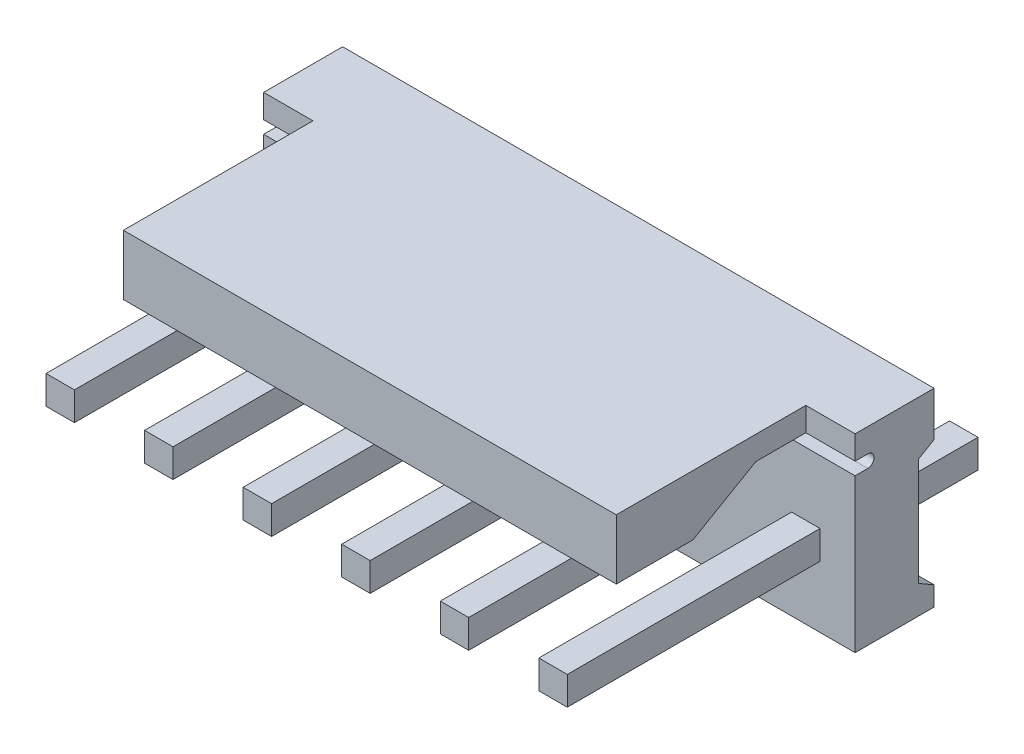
ISO-10303-21;
HEADER;
FILE_DESCRIPTION(('STEP AP214'),'2;1');
FILE_NAME('part.step','',(''),(''),'','','');
FILE_SCHEMA(('AUTOMOTIVE_DESIGN { 1 0 10303 214 1 1 1 1 }'));
ENDSEC;
DATA;
#1=APPLICATION_CONTEXT('core data for automotive mechanical design processes');
#2=APPLICATION_PROTOCOL_DEFINITION('international standard','automotive_design',2000,#1);
#3=PRODUCT_CONTEXT('',#1,'mechanical');
#4=PRODUCT('Part','Part','',(#3));
#5=PRODUCT_RELATED_PRODUCT_CATEGORY('part','',(#4));
#6=PRODUCT_DEFINITION_FORMATION('','',#4);
#7=PRODUCT_DEFINITION_CONTEXT('part definition',#1,'design');
#8=PRODUCT_DEFINITION('design','',#6,#7);
#9=PRODUCT_DEFINITION_SHAPE('','',#8);
#10=(LENGTH_UNIT() NAMED_UNIT(*) SI_UNIT(.MILLI.,.METRE.));
#11=(NAMED_UNIT(*) PLANE_ANGLE_UNIT() SI_UNIT($,.RADIAN.));
#12=(NAMED_UNIT(*) SI_UNIT($,.STERADIAN.) SOLID_ANGLE_UNIT());
#13=UNCERTAINTY_MEASURE_WITH_UNIT(LENGTH_MEASURE(1.E-05),#10,'distance_accuracy_value','');
#14=(GEOMETRIC_REPRESENTATION_CONTEXT(3) GLOBAL_UNCERTAINTY_ASSIGNED_CONTEXT((#13)) GLOBAL_UNIT_ASSIGNED_CONTEXT((#10,
#11,#12)) REPRESENTATION_CONTEXT('',''));
#15=CARTESIAN_POINT('',(0.,0.,0.));
#16=DIRECTION('',(0.,0.,1.));
#17=DIRECTION('',(1.,0.,0.));
#18=AXIS2_PLACEMENT_3D('',#15,#16,#17);
#19=CARTESIAN_POINT('',(10.4775,0.,7.62));
#20=DIRECTION('',(1.,0.,0.));
#21=DIRECTION('',(0.,0.,-1.));
#22=AXIS2_PLACEMENT_3D('',#19,#20,#21);
#23=PLANE('',#22);
#24=DIRECTION('',(0.,0.,-1.));
#25=VECTOR('',#24,1.);
#26=CARTESIAN_POINT('',(10.4775,-1.3335,10.16));
#27=LINE('',#26,#25);
#28=CARTESIAN_POINT('',(10.4775,-1.3335,0.));
#29=VERTEX_POINT('',#28);
#30=CARTESIAN_POINT('',(10.4775,-1.3335,10.16));
#31=VERTEX_POINT('',#30);
#32=EDGE_CURVE('E783',#29,#31,#27,.F.);
#33=ORIENTED_EDGE('',*,*,#32,.F.);
#34=DIRECTION('',(0.,1.,0.));
#35=VECTOR('',#34,1.);
#36=CARTESIAN_POINT('',(10.4775,0.,0.));
#37=LINE('',#36,#35);
#38=CARTESIAN_POINT('',(10.4775,-0.1905,0.));
#39=VERTEX_POINT('',#38);
#40=EDGE_CURVE('E831',#29,#39,#37,.T.);
#41=ORIENTED_EDGE('',*,*,#40,.T.);
#42=DIRECTION('',(0.,0.,1.));
#43=VECTOR('',#42,1.);
#44=CARTESIAN_POINT('',(10.4775,-0.1905,0.));
#45=LINE('',#44,#43);
#46=CARTESIAN_POINT('',(10.4775,-0.1905,10.16));
#47=VERTEX_POINT('',#46);
#48=EDGE_CURVE('E794',#47,#39,#45,.F.);
#49=ORIENTED_EDGE('',*,*,#48,.F.);
#50=DIRECTION('',(0.,1.,0.));
#51=VECTOR('',#50,1.);
#52=CARTESIAN_POINT('',(10.4775,-0.1905,10.16));
#53=LINE('',#52,#51);
#54=EDGE_CURVE('E789',#31,#47,#53,.T.);
#55=ORIENTED_EDGE('',*,*,#54,.F.);
#56=EDGE_LOOP('',(#33,#41,#49,#55));
#57=FACE_BOUND('',#56,.T.);
#58=ADVANCED_FACE('F18',(#57),#23,.T.);
#59=CARTESIAN_POINT('',(6.5151,0.,7.62));
#60=DIRECTION('',(1.,0.,0.));
#61=DIRECTION('',(0.,0.,-1.));
#62=AXIS2_PLACEMENT_3D('',#59,#60,#61);
#63=PLANE('',#62);
#64=DIRECTION('',(0.,0.,-1.));
#65=VECTOR('',#64,1.);
#66=CARTESIAN_POINT('',(6.5151,-1.3335,10.16));
#67=LINE('',#66,#65);
#68=CARTESIAN_POINT('',(6.5151,-1.3335,0.));
#69=VERTEX_POINT('',#68);
#70=CARTESIAN_POINT('',(6.5151,-1.3335,10.16));
#71=VERTEX_POINT('',#70);
#72=EDGE_CURVE('E763',#69,#71,#67,.F.);
#73=ORIENTED_EDGE('',*,*,#72,.F.);
#74=DIRECTION('',(0.,1.,0.));
#75=VECTOR('',#74,1.);
#76=CARTESIAN_POINT('',(6.5151,0.,0.));
#77=LINE('',#76,#75);
#78=CARTESIAN_POINT('',(6.5151,-0.1905,0.));
#79=VERTEX_POINT('',#78);
#80=EDGE_CURVE('E829',#69,#79,#77,.T.);
#81=ORIENTED_EDGE('',*,*,#80,.T.);
#82=DIRECTION('',(0.,0.,1.));
#83=VECTOR('',#82,1.);
#84=CARTESIAN_POINT('',(6.5151,-0.1905,0.));
#85=LINE('',#84,#83);
#86=CARTESIAN_POINT('',(6.5151,-0.1905,10.16));
#87=VERTEX_POINT('',#86);
#88=EDGE_CURVE('E774',#87,#79,#85,.F.);
#89=ORIENTED_EDGE('',*,*,#88,.F.);
#90=DIRECTION('',(0.,1.,0.));
#91=VECTOR('',#90,1.);
#92=CARTESIAN_POINT('',(6.5151,-0.1905,10.16));
#93=LINE('',#92,#91);
#94=EDGE_CURVE('E769',#71,#87,#93,.T.);
#95=ORIENTED_EDGE('',*,*,#94,.F.);
#96=EDGE_LOOP('',(#73,#81,#89,#95));
#97=FACE_BOUND('',#96,.T.);
#98=ADVANCED_FACE('F1223',(#97),#63,.T.);
#99=CARTESIAN_POINT('',(2.5527,0.,7.62));
#100=DIRECTION('',(1.,0.,0.));
#101=DIRECTION('',(0.,0.,-1.));
#102=AXIS2_PLACEMENT_3D('',#99,#100,#101);
#103=PLANE('',#102);
#104=DIRECTION('',(0.,0.,-1.));
#105=VECTOR('',#104,1.);
#106=CARTESIAN_POINT('',(2.5527,-1.3335,10.16));
#107=LINE('',#106,#105);
#108=CARTESIAN_POINT('',(2.5527,-1.3335,0.));
#109=VERTEX_POINT('',#108);
#110=CARTESIAN_POINT('',(2.5527,-1.3335,10.16));
#111=VERTEX_POINT('',#110);
#112=EDGE_CURVE('E743',#109,#111,#107,.F.);
#113=ORIENTED_EDGE('',*,*,#112,.F.);
#114=DIRECTION('',(0.,1.,0.));
#115=VECTOR('',#114,1.);
#116=CARTESIAN_POINT('',(2.5527,0.,0.));
#117=LINE('',#116,#115);
#118=CARTESIAN_POINT('',(2.5527,-0.1905,0.));
#119=VERTEX_POINT('',#118);
#120=EDGE_CURVE('E827',#109,#119,#117,.T.);
#121=ORIENTED_EDGE('',*,*,#120,.T.);
#122=DIRECTION('',(0.,0.,1.));
#123=VECTOR('',#122,1.);
#124=CARTESIAN_POINT('',(2.5527,-0.1905,0.));
#125=LINE('',#124,#123);
#126=CARTESIAN_POINT('',(2.5527,-0.1905,10.16));
#127=VERTEX_POINT('',#126);
#128=EDGE_CURVE('E754',#127,#119,#125,.F.);
#129=ORIENTED_EDGE('',*,*,#128,.F.);
#130=DIRECTION('',(0.,1.,0.));
#131=VECTOR('',#130,1.);
#132=CARTESIAN_POINT('',(2.5527,-0.1905,10.16));
#133=LINE('',#132,#131);
#134=EDGE_CURVE('E749',#111,#127,#133,.T.);
#135=ORIENTED_EDGE('',*,*,#134,.F.);
#136=EDGE_LOOP('',(#113,#121,#129,#135));
#137=FACE_BOUND('',#136,.T.);
#138=ADVANCED_FACE('F966',(#137),#103,.T.);
#139=CARTESIAN_POINT('',(-1.4097,0.,7.62));
#140=DIRECTION('',(1.,0.,0.));
#141=DIRECTION('',(0.,0.,-1.));
#142=AXIS2_PLACEMENT_3D('',#139,#140,#141);
#143=PLANE('',#142);
#144=DIRECTION('',(0.,0.,-1.));
#145=VECTOR('',#144,1.);
#146=CARTESIAN_POINT('',(-1.4097,-1.3335,10.16));
#147=LINE('',#146,#145);
#148=CARTESIAN_POINT('',(-1.4097,-1.3335,0.));
#149=VERTEX_POINT('',#148);
#150=CARTESIAN_POINT('',(-1.4097,-1.3335,10.16));
#151=VERTEX_POINT('',#150);
#152=EDGE_CURVE('E723',#149,#151,#147,.F.);
#153=ORIENTED_EDGE('',*,*,#152,.F.);
#154=DIRECTION('',(0.,1.,0.));
#155=VECTOR('',#154,1.);
#156=CARTESIAN_POINT('',(-1.4097,0.,0.));
#157=LINE('',#156,#155);
#158=CARTESIAN_POINT('',(-1.4097,-0.1905,0.));
#159=VERTEX_POINT('',#158);
#160=EDGE_CURVE('E825',#149,#159,#157,.T.);
#161=ORIENTED_EDGE('',*,*,#160,.T.);
#162=DIRECTION('',(0.,0.,1.));
#163=VECTOR('',#162,1.);
#164=CARTESIAN_POINT('',(-1.4097,-0.1905,0.));
#165=LINE('',#164,#163);
#166=CARTESIAN_POINT('',(-1.4097,-0.1905,10.16));
#167=VERTEX_POINT('',#166);
#168=EDGE_CURVE('E734',#167,#159,#165,.F.);
#169=ORIENTED_EDGE('',*,*,#168,.F.);
#170=DIRECTION('',(0.,1.,0.));
#171=VECTOR('',#170,1.);
#172=CARTESIAN_POINT('',(-1.4097,-0.1905,10.16));
#173=LINE('',#172,#171);
#174=EDGE_CURVE('E729',#151,#167,#173,.T.);
#175=ORIENTED_EDGE('',*,*,#174,.F.);
#176=EDGE_LOOP('',(#153,#161,#169,#175));
#177=FACE_BOUND('',#176,.T.);
#178=ADVANCED_FACE('F1210',(#177),#143,.T.);
#179=CARTESIAN_POINT('',(-5.3721,0.,7.62));
#180=DIRECTION('',(1.,0.,0.));
#181=DIRECTION('',(0.,0.,-1.));
#182=AXIS2_PLACEMENT_3D('',#179,#180,#181);
#183=PLANE('',#182);
#184=DIRECTION('',(0.,0.,-1.));
#185=VECTOR('',#184,1.);
#186=CARTESIAN_POINT('',(-5.3721,-1.3335,10.16));
#187=LINE('',#186,#185);
#188=CARTESIAN_POINT('',(-5.3721,-1.3335,0.));
#189=VERTEX_POINT('',#188);
#190=CARTESIAN_POINT('',(-5.3721,-1.3335,10.16));
#191=VERTEX_POINT('',#190);
#192=EDGE_CURVE('E703',#189,#191,#187,.F.);
#193=ORIENTED_EDGE('',*,*,#192,.F.);
#194=DIRECTION('',(0.,1.,0.));
#195=VECTOR('',#194,1.);
#196=CARTESIAN_POINT('',(-5.3721,0.,0.));
#197=LINE('',#196,#195);
#198=CARTESIAN_POINT('',(-5.3721,-0.1905,0.));
#199=VERTEX_POINT('',#198);
#200=EDGE_CURVE('E823',#189,#199,#197,.T.);
#201=ORIENTED_EDGE('',*,*,#200,.T.);
#202=DIRECTION('',(0.,0.,1.));
#203=VECTOR('',#202,1.);
#204=CARTESIAN_POINT('',(-5.3721,-0.1905,0.));
#205=LINE('',#204,#203);
#206=CARTESIAN_POINT('',(-5.3721,-0.1905,10.16));
#207=VERTEX_POINT('',#206);
#208=EDGE_CURVE('E714',#207,#199,#205,.F.);
#209=ORIENTED_EDGE('',*,*,#208,.F.);
#210=DIRECTION('',(0.,1.,0.));
#211=VECTOR('',#210,1.);
#212=CARTESIAN_POINT('',(-5.3721,-0.1905,10.16));
#213=LINE('',#212,#211);
#214=EDGE_CURVE('E709',#191,#207,#213,.T.);
#215=ORIENTED_EDGE('',*,*,#214,.F.);
#216=EDGE_LOOP('',(#193,#201,#209,#215));
#217=FACE_BOUND('',#216,.T.);
#218=ADVANCED_FACE('F1214',(#217),#183,.T.);
#219=CARTESIAN_POINT('',(-9.3345,0.,7.62));
#220=DIRECTION('',(1.,0.,0.));
#221=DIRECTION('',(0.,0.,-1.));
#222=AXIS2_PLACEMENT_3D('',#219,#220,#221);
#223=PLANE('',#222);
#224=DIRECTION('',(0.,0.,-1.));
#225=VECTOR('',#224,1.);
#226=CARTESIAN_POINT('',(-9.3345,-1.3335,10.16));
#227=LINE('',#226,#225);
#228=CARTESIAN_POINT('',(-9.3345,-1.3335,0.));
#229=VERTEX_POINT('',#228);
#230=CARTESIAN_POINT('',(-9.3345,-1.3335,10.16));
#231=VERTEX_POINT('',#230);
#232=EDGE_CURVE('E683',#229,#231,#227,.F.);
#233=ORIENTED_EDGE('',*,*,#232,.F.);
#234=DIRECTION('',(0.,1.,0.));
#235=VECTOR('',#234,1.);
#236=CARTESIAN_POINT('',(-9.3345,0.,0.));
#237=LINE('',#236,#235);
#238=CARTESIAN_POINT('',(-9.3345,-0.1905,0.));
#239=VERTEX_POINT('',#238);
#240=EDGE_CURVE('E821',#229,#239,#237,.T.);
#241=ORIENTED_EDGE('',*,*,#240,.T.);
#242=DIRECTION('',(0.,0.,1.));
#243=VECTOR('',#242,1.);
#244=CARTESIAN_POINT('',(-9.3345,-0.1905,0.));
#245=LINE('',#244,#243);
#246=CARTESIAN_POINT('',(-9.3345,-0.1905,10.16));
#247=VERTEX_POINT('',#246);
#248=EDGE_CURVE('E694',#247,#239,#245,.F.);
#249=ORIENTED_EDGE('',*,*,#248,.F.);
#250=DIRECTION('',(0.,1.,0.));
#251=VECTOR('',#250,1.);
#252=CARTESIAN_POINT('',(-9.3345,-0.1905,10.16));
#253=LINE('',#252,#251);
#254=EDGE_CURVE('E689',#231,#247,#253,.T.);
#255=ORIENTED_EDGE('',*,*,#254,.F.);
#256=EDGE_LOOP('',(#233,#241,#249,#255));
#257=FACE_BOUND('',#256,.T.);
#258=ADVANCED_FACE('F1220',(#257),#223,.T.);
#259=CARTESIAN_POINT('',(10.4775,0.,7.62));
#260=DIRECTION('',(1.,0.,0.));
#261=DIRECTION('',(0.,0.,-1.));
#262=AXIS2_PLACEMENT_3D('',#259,#260,#261);
#263=PLANE('',#262);
#264=DIRECTION('',(0.,0.,1.));
#265=VECTOR('',#264,1.);
#266=CARTESIAN_POINT('',(10.4775,-0.1905,-6.35));
#267=LINE('',#266,#265);
#268=CARTESIAN_POINT('',(10.4775,-0.1905,-2.54));
#269=VERTEX_POINT('',#268);
#270=CARTESIAN_POINT('',(10.4775,-0.1905,-6.35));
#271=VERTEX_POINT('',#270);
#272=EDGE_CURVE('E663',#269,#271,#267,.F.);
#273=ORIENTED_EDGE('',*,*,#272,.F.);
#274=DIRECTION('',(0.,1.,0.));
#275=VECTOR('',#274,1.);
#276=CARTESIAN_POINT('',(10.4775,0.,-2.54));
#277=LINE('',#276,#275);
#278=CARTESIAN_POINT('',(10.4775,-1.3335,-2.54));
#279=VERTEX_POINT('',#278);
#280=EDGE_CURVE('E819',#269,#279,#277,.F.);
#281=ORIENTED_EDGE('',*,*,#280,.T.);
#282=DIRECTION('',(0.,0.,-1.));
#283=VECTOR('',#282,1.);
#284=CARTESIAN_POINT('',(10.4775,-1.3335,-2.54));
#285=LINE('',#284,#283);
#286=CARTESIAN_POINT('',(10.4775,-1.3335,-6.35));
#287=VERTEX_POINT('',#286);
#288=EDGE_CURVE('E674',#287,#279,#285,.F.);
#289=ORIENTED_EDGE('',*,*,#288,.F.);
#290=DIRECTION('',(0.,1.,0.));
#291=VECTOR('',#290,1.);
#292=CARTESIAN_POINT('',(10.4775,-1.3335,-6.35));
#293=LINE('',#292,#291);
#294=EDGE_CURVE('E669',#271,#287,#293,.F.);
#295=ORIENTED_EDGE('',*,*,#294,.F.);
#296=EDGE_LOOP('',(#273,#281,#289,#295));
#297=FACE_BOUND('',#296,.T.);
#298=ADVANCED_FACE('F1279',(#297),#263,.T.);
#299=CARTESIAN_POINT('',(6.5151,0.,7.62));
#300=DIRECTION('',(1.,0.,0.));
#301=DIRECTION('',(0.,0.,-1.));
#302=AXIS2_PLACEMENT_3D('',#299,#300,#301);
#303=PLANE('',#302);
#304=DIRECTION('',(0.,0.,1.));
#305=VECTOR('',#304,1.);
#306=CARTESIAN_POINT('',(6.5151,-0.1905,-6.35));
#307=LINE('',#306,#305);
#308=CARTESIAN_POINT('',(6.5151,-0.1905,-2.54));
#309=VERTEX_POINT('',#308);
#310=CARTESIAN_POINT('',(6.5151,-0.1905,-6.35));
#311=VERTEX_POINT('',#310);
#312=EDGE_CURVE('E643',#309,#311,#307,.F.);
#313=ORIENTED_EDGE('',*,*,#312,.F.);
#314=DIRECTION('',(0.,1.,0.));
#315=VECTOR('',#314,1.);
#316=CARTESIAN_POINT('',(6.5151,0.,-2.54));
#317=LINE('',#316,#315);
#318=CARTESIAN_POINT('',(6.5151,-1.3335,-2.54));
#319=VERTEX_POINT('',#318);
#320=EDGE_CURVE('E817',#309,#319,#317,.F.);
#321=ORIENTED_EDGE('',*,*,#320,.T.);
#322=DIRECTION('',(0.,0.,-1.));
#323=VECTOR('',#322,1.);
#324=CARTESIAN_POINT('',(6.5151,-1.3335,-2.54));
#325=LINE('',#324,#323);
#326=CARTESIAN_POINT('',(6.5151,-1.3335,-6.35));
#327=VERTEX_POINT('',#326);
#328=EDGE_CURVE('E654',#327,#319,#325,.F.);
#329=ORIENTED_EDGE('',*,*,#328,.F.);
#330=DIRECTION('',(0.,1.,0.));
#331=VECTOR('',#330,1.);
#332=CARTESIAN_POINT('',(6.5151,-1.3335,-6.35));
#333=LINE('',#332,#331);
#334=EDGE_CURVE('E649',#311,#327,#333,.F.);
#335=ORIENTED_EDGE('',*,*,#334,.F.);
#336=EDGE_LOOP('',(#313,#321,#329,#335));
#337=FACE_BOUND('',#336,.T.);
#338=ADVANCED_FACE('F1275',(#337),#303,.T.);
#339=CARTESIAN_POINT('',(2.5527,0.,7.62));
#340=DIRECTION('',(1.,0.,0.));
#341=DIRECTION('',(0.,0.,-1.));
#342=AXIS2_PLACEMENT_3D('',#339,#340,#341);
#343=PLANE('',#342);
#344=DIRECTION('',(0.,0.,1.));
#345=VECTOR('',#344,1.);
#346=CARTESIAN_POINT('',(2.5527,-0.1905,-6.35));
#347=LINE('',#346,#345);
#348=CARTESIAN_POINT('',(2.5527,-0.1905,-2.54));
#349=VERTEX_POINT('',#348);
#350=CARTESIAN_POINT('',(2.5527,-0.1905,-6.35));
#351=VERTEX_POINT('',#350);
#352=EDGE_CURVE('E623',#349,#351,#347,.F.);
#353=ORIENTED_EDGE('',*,*,#352,.F.);
#354=DIRECTION('',(0.,1.,0.));
#355=VECTOR('',#354,1.);
#356=CARTESIAN_POINT('',(2.5527,0.,-2.54));
#357=LINE('',#356,#355);
#358=CARTESIAN_POINT('',(2.5527,-1.3335,-2.54));
#359=VERTEX_POINT('',#358);
#360=EDGE_CURVE('E815',#349,#359,#357,.F.);
#361=ORIENTED_EDGE('',*,*,#360,.T.);
#362=DIRECTION('',(0.,0.,-1.));
#363=VECTOR('',#362,1.);
#364=CARTESIAN_POINT('',(2.5527,-1.3335,-2.54));
#365=LINE('',#364,#363);
#366=CARTESIAN_POINT('',(2.5527,-1.3335,-6.35));
#367=VERTEX_POINT('',#366);
#368=EDGE_CURVE('E634',#367,#359,#365,.F.);
#369=ORIENTED_EDGE('',*,*,#368,.F.);
#370=DIRECTION('',(0.,1.,0.));
#371=VECTOR('',#370,1.);
#372=CARTESIAN_POINT('',(2.5527,-1.3335,-6.35));
#373=LINE('',#372,#371);
#374=EDGE_CURVE('E629',#351,#367,#373,.F.);
#375=ORIENTED_EDGE('',*,*,#374,.F.);
#376=EDGE_LOOP('',(#353,#361,#369,#375));
#377=FACE_BOUND('',#376,.T.);
#378=ADVANCED_FACE('F1271',(#377),#343,.T.);
#379=CARTESIAN_POINT('',(-1.4097,0.,7.62));
#380=DIRECTION('',(1.,0.,0.));
#381=DIRECTION('',(0.,0.,-1.));
#382=AXIS2_PLACEMENT_3D('',#379,#380,#381);
#383=PLANE('',#382);
#384=DIRECTION('',(0.,0.,1.));
#385=VECTOR('',#384,1.);
#386=CARTESIAN_POINT('',(-1.4097,-0.1905,-6.35));
#387=LINE('',#386,#385);
#388=CARTESIAN_POINT('',(-1.4097,-0.1905,-2.54));
#389=VERTEX_POINT('',#388);
#390=CARTESIAN_POINT('',(-1.4097,-0.1905,-6.35));
#391=VERTEX_POINT('',#390);
#392=EDGE_CURVE('E603',#389,#391,#387,.F.);
#393=ORIENTED_EDGE('',*,*,#392,.F.);
#394=DIRECTION('',(0.,1.,0.));
#395=VECTOR('',#394,1.);
#396=CARTESIAN_POINT('',(-1.4097,0.,-2.54));
#397=LINE('',#396,#395);
#398=CARTESIAN_POINT('',(-1.4097,-1.3335,-2.54));
#399=VERTEX_POINT('',#398);
#400=EDGE_CURVE('E813',#389,#399,#397,.F.);
#401=ORIENTED_EDGE('',*,*,#400,.T.);
#402=DIRECTION('',(0.,0.,-1.));
#403=VECTOR('',#402,1.);
#404=CARTESIAN_POINT('',(-1.4097,-1.3335,-2.54));
#405=LINE('',#404,#403);
#406=CARTESIAN_POINT('',(-1.4097,-1.3335,-6.35));
#407=VERTEX_POINT('',#406);
#408=EDGE_CURVE('E614',#407,#399,#405,.F.);
#409=ORIENTED_EDGE('',*,*,#408,.F.);
#410=DIRECTION('',(0.,1.,0.));
#411=VECTOR('',#410,1.);
#412=CARTESIAN_POINT('',(-1.4097,-1.3335,-6.35));
#413=LINE('',#412,#411);
#414=EDGE_CURVE('E609',#391,#407,#413,.F.);
#415=ORIENTED_EDGE('',*,*,#414,.F.);
#416=EDGE_LOOP('',(#393,#401,#409,#415));
#417=FACE_BOUND('',#416,.T.);
#418=ADVANCED_FACE('F1267',(#417),#383,.T.);
#419=CARTESIAN_POINT('',(-5.3721,0.,7.62));
#420=DIRECTION('',(1.,0.,0.));
#421=DIRECTION('',(0.,0.,-1.));
#422=AXIS2_PLACEMENT_3D('',#419,#420,#421);
#423=PLANE('',#422);
#424=DIRECTION('',(0.,0.,1.));
#425=VECTOR('',#424,1.);
#426=CARTESIAN_POINT('',(-5.3721,-0.1905,-6.35));
#427=LINE('',#426,#425);
#428=CARTESIAN_POINT('',(-5.3721,-0.1905,-2.54));
#429=VERTEX_POINT('',#428);
#430=CARTESIAN_POINT('',(-5.3721,-0.1905,-6.35));
#431=VERTEX_POINT('',#430);
#432=EDGE_CURVE('E583',#429,#431,#427,.F.);
#433=ORIENTED_EDGE('',*,*,#432,.F.);
#434=DIRECTION('',(0.,1.,0.));
#435=VECTOR('',#434,1.);
#436=CARTESIAN_POINT('',(-5.3721,0.,-2.54));
#437=LINE('',#436,#435);
#438=CARTESIAN_POINT('',(-5.3721,-1.3335,-2.54));
#439=VERTEX_POINT('',#438);
#440=EDGE_CURVE('E811',#429,#439,#437,.F.);
#441=ORIENTED_EDGE('',*,*,#440,.T.);
#442=DIRECTION('',(0.,0.,-1.));
#443=VECTOR('',#442,1.);
#444=CARTESIAN_POINT('',(-5.3721,-1.3335,-2.54));
#445=LINE('',#444,#443);
#446=CARTESIAN_POINT('',(-5.3721,-1.3335,-6.35));
#447=VERTEX_POINT('',#446);
#448=EDGE_CURVE('E594',#447,#439,#445,.F.);
#449=ORIENTED_EDGE('',*,*,#448,.F.);
#450=DIRECTION('',(0.,1.,0.));
#451=VECTOR('',#450,1.);
#452=CARTESIAN_POINT('',(-5.3721,-1.3335,-6.35));
#453=LINE('',#452,#451);
#454=EDGE_CURVE('E589',#431,#447,#453,.F.);
#455=ORIENTED_EDGE('',*,*,#454,.F.);
#456=EDGE_LOOP('',(#433,#441,#449,#455));
#457=FACE_BOUND('',#456,.T.);
#458=ADVANCED_FACE('F1263',(#457),#423,.T.);
#459=CARTESIAN_POINT('',(-9.3345,0.,7.62));
#460=DIRECTION('',(1.,0.,0.));
#461=DIRECTION('',(0.,0.,-1.));
#462=AXIS2_PLACEMENT_3D('',#459,#460,#461);
#463=PLANE('',#462);
#464=DIRECTION('',(0.,0.,1.));
#465=VECTOR('',#464,1.);
#466=CARTESIAN_POINT('',(-9.3345,-0.1905,-6.35));
#467=LINE('',#466,#465);
#468=CARTESIAN_POINT('',(-9.3345,-0.1905,-2.54));
#469=VERTEX_POINT('',#468);
#470=CARTESIAN_POINT('',(-9.3345,-0.1905,-6.35));
#471=VERTEX_POINT('',#470);
#472=EDGE_CURVE('E563',#469,#471,#467,.F.);
#473=ORIENTED_EDGE('',*,*,#472,.F.);
#474=DIRECTION('',(0.,1.,0.));
#475=VECTOR('',#474,1.);
#476=CARTESIAN_POINT('',(-9.3345,0.,-2.54));
#477=LINE('',#476,#475);
#478=CARTESIAN_POINT('',(-9.3345,-1.3335,-2.54));
#479=VERTEX_POINT('',#478);
#480=EDGE_CURVE('E797',#469,#479,#477,.F.);
#481=ORIENTED_EDGE('',*,*,#480,.T.);
#482=DIRECTION('',(0.,0.,-1.));
#483=VECTOR('',#482,1.);
#484=CARTESIAN_POINT('',(-9.3345,-1.3335,-2.54));
#485=LINE('',#484,#483);
#486=CARTESIAN_POINT('',(-9.3345,-1.3335,-6.35));
#487=VERTEX_POINT('',#486);
#488=EDGE_CURVE('E574',#487,#479,#485,.F.);
#489=ORIENTED_EDGE('',*,*,#488,.F.);
#490=DIRECTION('',(0.,1.,0.));
#491=VECTOR('',#490,1.);
#492=CARTESIAN_POINT('',(-9.3345,-1.3335,-6.35));
#493=LINE('',#492,#491);
#494=EDGE_CURVE('E569',#471,#487,#493,.F.);
#495=ORIENTED_EDGE('',*,*,#494,.F.);
#496=EDGE_LOOP('',(#473,#481,#489,#495));
#497=FACE_BOUND('',#496,.T.);
#498=ADVANCED_FACE('F1260',(#497),#463,.T.);
#499=CARTESIAN_POINT('',(9.3345,-0.1905,0.));
#500=DIRECTION('',(0.,1.,0.));
#501=DIRECTION('',(0.,0.,1.));
#502=AXIS2_PLACEMENT_3D('',#499,#500,#501);
#503=PLANE('',#502);
#504=ORIENTED_EDGE('',*,*,#48,.T.);
#505=DIRECTION('',(1.,0.,0.));
#506=VECTOR('',#505,1.);
#507=CARTESIAN_POINT('',(9.3345,-0.1905,0.));
#508=LINE('',#507,#506);
#509=CARTESIAN_POINT('',(9.3345,-0.1905,0.));
#510=VERTEX_POINT('',#509);
#511=EDGE_CURVE('E792',#39,#510,#508,.F.);
#512=ORIENTED_EDGE('',*,*,#511,.T.);
#513=DIRECTION('',(0.,0.,-1.));
#514=VECTOR('',#513,1.);
#515=CARTESIAN_POINT('',(9.3345,-0.1905,7.62));
#516=LINE('',#515,#514);
#517=CARTESIAN_POINT('',(9.3345,-0.1905,10.16));
#518=VERTEX_POINT('',#517);
#519=EDGE_CURVE('E439',#510,#518,#516,.F.);
#520=ORIENTED_EDGE('',*,*,#519,.T.);
#521=DIRECTION('',(1.,0.,0.));
#522=VECTOR('',#521,1.);
#523=CARTESIAN_POINT('',(9.3345,-0.1905,10.16));
#524=LINE('',#523,#522);
#525=EDGE_CURVE('E786',#47,#518,#524,.F.);
#526=ORIENTED_EDGE('',*,*,#525,.F.);
#527=EDGE_LOOP('',(#504,#512,#520,#526));
#528=FACE_BOUND('',#527,.T.);
#529=ADVANCED_FACE('F843',(#528),#503,.T.);
#530=CARTESIAN_POINT('',(9.3345,-0.1905,10.16));
#531=DIRECTION('',(0.,0.,1.));
#532=DIRECTION('',(1.,0.,0.));
#533=AXIS2_PLACEMENT_3D('',#530,#531,#532);
#534=PLANE('',#533);
#535=ORIENTED_EDGE('',*,*,#525,.T.);
#536=DIRECTION('',(0.,1.,0.));
#537=VECTOR('',#536,1.);
#538=CARTESIAN_POINT('',(9.3345,0.,10.16));
#539=LINE('',#538,#537);
#540=CARTESIAN_POINT('',(9.3345,-1.3335,10.16));
#541=VERTEX_POINT('',#540);
#542=EDGE_CURVE('E555',#518,#541,#539,.F.);
#543=ORIENTED_EDGE('',*,*,#542,.T.);
#544=DIRECTION('',(1.,0.,0.));
#545=VECTOR('',#544,1.);
#546=CARTESIAN_POINT('',(9.3345,-1.3335,10.16));
#547=LINE('',#546,#545);
#548=EDGE_CURVE('E780',#31,#541,#547,.F.);
#549=ORIENTED_EDGE('',*,*,#548,.F.);
#550=ORIENTED_EDGE('',*,*,#54,.T.);
#551=EDGE_LOOP('',(#535,#543,#549,#550));
#552=FACE_BOUND('',#551,.T.);
#553=ADVANCED_FACE('F847',(#552),#534,.T.);
#554=CARTESIAN_POINT('',(9.3345,-1.3335,10.16));
#555=DIRECTION('',(0.,-1.,0.));
#556=DIRECTION('',(0.,0.,-1.));
#557=AXIS2_PLACEMENT_3D('',#554,#555,#556);
#558=PLANE('',#557);
#559=DIRECTION('',(0.,0.,-1.));
#560=VECTOR('',#559,1.);
#561=CARTESIAN_POINT('',(9.3345,-1.3335,7.62));
#562=LINE('',#561,#560);
#563=CARTESIAN_POINT('',(9.3345,-1.3335,0.));
#564=VERTEX_POINT('',#563);
#565=EDGE_CURVE('E552',#541,#564,#562,.T.);
#566=ORIENTED_EDGE('',*,*,#565,.T.);
#567=DIRECTION('',(1.,0.,0.));
#568=VECTOR('',#567,1.);
#569=CARTESIAN_POINT('',(9.3345,-1.3335,0.));
#570=LINE('',#569,#568);
#571=EDGE_CURVE('E777',#564,#29,#570,.T.);
#572=ORIENTED_EDGE('',*,*,#571,.T.);
#573=ORIENTED_EDGE('',*,*,#32,.T.);
#574=ORIENTED_EDGE('',*,*,#548,.T.);
#575=EDGE_LOOP('',(#566,#572,#573,#574));
#576=FACE_BOUND('',#575,.T.);
#577=ADVANCED_FACE('F850',(#576),#558,.T.);
#578=CARTESIAN_POINT('',(5.3721,-0.1905,0.));
#579=DIRECTION('',(0.,1.,0.));
#580=DIRECTION('',(0.,0.,1.));
#581=AXIS2_PLACEMENT_3D('',#578,#579,#580);
#582=PLANE('',#581);
#583=ORIENTED_EDGE('',*,*,#88,.T.);
#584=DIRECTION('',(1.,0.,0.));
#585=VECTOR('',#584,1.);
#586=CARTESIAN_POINT('',(5.3721,-0.1905,0.));
#587=LINE('',#586,#585);
#588=CARTESIAN_POINT('',(5.3721,-0.1905,0.));
#589=VERTEX_POINT('',#588);
#590=EDGE_CURVE('E772',#79,#589,#587,.F.);
#591=ORIENTED_EDGE('',*,*,#590,.T.);
#592=DIRECTION('',(0.,0.,-1.));
#593=VECTOR('',#592,1.);
#594=CARTESIAN_POINT('',(5.3721,-0.1905,7.62));
#595=LINE('',#594,#593);
#596=CARTESIAN_POINT('',(5.3721,-0.1905,10.16));
#597=VERTEX_POINT('',#596);
#598=EDGE_CURVE('E550',#589,#597,#595,.F.);
#599=ORIENTED_EDGE('',*,*,#598,.T.);
#600=DIRECTION('',(1.,0.,0.));
#601=VECTOR('',#600,1.);
#602=CARTESIAN_POINT('',(5.3721,-0.1905,10.16));
#603=LINE('',#602,#601);
#604=EDGE_CURVE('E766',#87,#597,#603,.F.);
#605=ORIENTED_EDGE('',*,*,#604,.F.);
#606=EDGE_LOOP('',(#583,#591,#599,#605));
#607=FACE_BOUND('',#606,.T.);
#608=ADVANCED_FACE('F1240',(#607),#582,.T.);
#609=CARTESIAN_POINT('',(5.3721,-0.1905,10.16));
#610=DIRECTION('',(0.,0.,1.));
#611=DIRECTION('',(1.,0.,0.));
#612=AXIS2_PLACEMENT_3D('',#609,#610,#611);
#613=PLANE('',#612);
#614=ORIENTED_EDGE('',*,*,#604,.T.);
#615=DIRECTION('',(0.,1.,0.));
#616=VECTOR('',#615,1.);
#617=CARTESIAN_POINT('',(5.3721,0.,10.16));
#618=LINE('',#617,#616);
#619=CARTESIAN_POINT('',(5.3721,-1.3335,10.16));
#620=VERTEX_POINT('',#619);
#621=EDGE_CURVE('E548',#597,#620,#618,.F.);
#622=ORIENTED_EDGE('',*,*,#621,.T.);
#623=DIRECTION('',(1.,0.,0.));
#624=VECTOR('',#623,1.);
#625=CARTESIAN_POINT('',(5.3721,-1.3335,10.16));
#626=LINE('',#625,#624);
#627=EDGE_CURVE('E760',#71,#620,#626,.F.);
#628=ORIENTED_EDGE('',*,*,#627,.F.);
#629=ORIENTED_EDGE('',*,*,#94,.T.);
#630=EDGE_LOOP('',(#614,#622,#628,#629));
#631=FACE_BOUND('',#630,.T.);
#632=ADVANCED_FACE('F1243',(#631),#613,.T.);
#633=CARTESIAN_POINT('',(5.3721,-1.3335,10.16));
#634=DIRECTION('',(0.,-1.,0.));
#635=DIRECTION('',(0.,0.,-1.));
#636=AXIS2_PLACEMENT_3D('',#633,#634,#635);
#637=PLANE('',#636);
#638=DIRECTION('',(0.,0.,-1.));
#639=VECTOR('',#638,1.);
#640=CARTESIAN_POINT('',(5.3721,-1.3335,7.62));
#641=LINE('',#640,#639);
#642=CARTESIAN_POINT('',(5.3721,-1.3335,0.));
#643=VERTEX_POINT('',#642);
#644=EDGE_CURVE('E545',#620,#643,#641,.T.);
#645=ORIENTED_EDGE('',*,*,#644,.T.);
#646=DIRECTION('',(1.,0.,0.));
#647=VECTOR('',#646,1.);
#648=CARTESIAN_POINT('',(5.3721,-1.3335,0.));
#649=LINE('',#648,#647);
#650=EDGE_CURVE('E757',#643,#69,#649,.T.);
#651=ORIENTED_EDGE('',*,*,#650,.T.);
#652=ORIENTED_EDGE('',*,*,#72,.T.);
#653=ORIENTED_EDGE('',*,*,#627,.T.);
#654=EDGE_LOOP('',(#645,#651,#652,#653));
#655=FACE_BOUND('',#654,.T.);
#656=ADVANCED_FACE('F1234',(#655),#637,.T.);
#657=CARTESIAN_POINT('',(1.4097,-0.1905,0.));
#658=DIRECTION('',(0.,1.,0.));
#659=DIRECTION('',(0.,0.,1.));
#660=AXIS2_PLACEMENT_3D('',#657,#658,#659);
#661=PLANE('',#660);
#662=ORIENTED_EDGE('',*,*,#128,.T.);
#663=DIRECTION('',(1.,0.,0.));
#664=VECTOR('',#663,1.);
#665=CARTESIAN_POINT('',(1.4097,-0.1905,0.));
#666=LINE('',#665,#664);
#667=CARTESIAN_POINT('',(1.4097,-0.1905,0.));
#668=VERTEX_POINT('',#667);
#669=EDGE_CURVE('E752',#119,#668,#666,.F.);
#670=ORIENTED_EDGE('',*,*,#669,.T.);
#671=DIRECTION('',(0.,0.,-1.));
#672=VECTOR('',#671,1.);
#673=CARTESIAN_POINT('',(1.4097,-0.1905,7.62));
#674=LINE('',#673,#672);
#675=CARTESIAN_POINT('',(1.4097,-0.1905,10.16));
#676=VERTEX_POINT('',#675);
#677=EDGE_CURVE('E543',#668,#676,#674,.F.);
#678=ORIENTED_EDGE('',*,*,#677,.T.);
#679=DIRECTION('',(1.,0.,0.));
#680=VECTOR('',#679,1.);
#681=CARTESIAN_POINT('',(1.4097,-0.1905,10.16));
#682=LINE('',#681,#680);
#683=EDGE_CURVE('E746',#127,#676,#682,.F.);
#684=ORIENTED_EDGE('',*,*,#683,.F.);
#685=EDGE_LOOP('',(#662,#670,#678,#684));
#686=FACE_BOUND('',#685,.T.);
#687=ADVANCED_FACE('F960',(#686),#661,.T.);
#688=CARTESIAN_POINT('',(1.4097,-0.1905,10.16));
#689=DIRECTION('',(0.,0.,1.));
#690=DIRECTION('',(1.,0.,0.));
#691=AXIS2_PLACEMENT_3D('',#688,#689,#690);
#692=PLANE('',#691);
#693=ORIENTED_EDGE('',*,*,#683,.T.);
#694=DIRECTION('',(0.,1.,0.));
#695=VECTOR('',#694,1.);
#696=CARTESIAN_POINT('',(1.4097,0.,10.16));
#697=LINE('',#696,#695);
#698=CARTESIAN_POINT('',(1.4097,-1.3335,10.16));
#699=VERTEX_POINT('',#698);
#700=EDGE_CURVE('E541',#676,#699,#697,.F.);
#701=ORIENTED_EDGE('',*,*,#700,.T.);
#702=DIRECTION('',(1.,0.,0.));
#703=VECTOR('',#702,1.);
#704=CARTESIAN_POINT('',(1.4097,-1.3335,10.16));
#705=LINE('',#704,#703);
#706=EDGE_CURVE('E740',#111,#699,#705,.F.);
#707=ORIENTED_EDGE('',*,*,#706,.F.);
#708=ORIENTED_EDGE('',*,*,#134,.T.);
#709=EDGE_LOOP('',(#693,#701,#707,#708));
#710=FACE_BOUND('',#709,.T.);
#711=ADVANCED_FACE('F962',(#710),#692,.T.);
#712=CARTESIAN_POINT('',(1.4097,-1.3335,10.16));
#713=DIRECTION('',(0.,-1.,0.));
#714=DIRECTION('',(0.,0.,-1.));
#715=AXIS2_PLACEMENT_3D('',#712,#713,#714);
#716=PLANE('',#715);
#717=DIRECTION('',(0.,0.,-1.));
#718=VECTOR('',#717,1.);
#719=CARTESIAN_POINT('',(1.4097,-1.3335,7.62));
#720=LINE('',#719,#718);
#721=CARTESIAN_POINT('',(1.4097,-1.3335,0.));
#722=VERTEX_POINT('',#721);
#723=EDGE_CURVE('E538',#699,#722,#720,.T.);
#724=ORIENTED_EDGE('',*,*,#723,.T.);
#725=DIRECTION('',(1.,0.,0.));
#726=VECTOR('',#725,1.);
#727=CARTESIAN_POINT('',(1.4097,-1.3335,0.));
#728=LINE('',#727,#726);
#729=EDGE_CURVE('E737',#722,#109,#728,.T.);
#730=ORIENTED_EDGE('',*,*,#729,.T.);
#731=ORIENTED_EDGE('',*,*,#112,.T.);
#732=ORIENTED_EDGE('',*,*,#706,.T.);
#733=EDGE_LOOP('',(#724,#730,#731,#732));
#734=FACE_BOUND('',#733,.T.);
#735=ADVANCED_FACE('F968',(#734),#716,.T.);
#736=CARTESIAN_POINT('',(-2.5527,-0.1905,0.));
#737=DIRECTION('',(0.,1.,0.));
#738=DIRECTION('',(0.,0.,1.));
#739=AXIS2_PLACEMENT_3D('',#736,#737,#738);
#740=PLANE('',#739);
#741=ORIENTED_EDGE('',*,*,#168,.T.);
#742=DIRECTION('',(1.,0.,0.));
#743=VECTOR('',#742,1.);
#744=CARTESIAN_POINT('',(-2.5527,-0.1905,0.));
#745=LINE('',#744,#743);
#746=CARTESIAN_POINT('',(-2.5527,-0.1905,0.));
#747=VERTEX_POINT('',#746);
#748=EDGE_CURVE('E732',#159,#747,#745,.F.);
#749=ORIENTED_EDGE('',*,*,#748,.T.);
#750=DIRECTION('',(0.,0.,-1.));
#751=VECTOR('',#750,1.);
#752=CARTESIAN_POINT('',(-2.5527,-0.1905,7.62));
#753=LINE('',#752,#751);
#754=CARTESIAN_POINT('',(-2.5527,-0.1905,10.16));
#755=VERTEX_POINT('',#754);
#756=EDGE_CURVE('E536',#747,#755,#753,.F.);
#757=ORIENTED_EDGE('',*,*,#756,.T.);
#758=DIRECTION('',(1.,0.,0.));
#759=VECTOR('',#758,1.);
#760=CARTESIAN_POINT('',(-2.5527,-0.1905,10.16));
#761=LINE('',#760,#759);
#762=EDGE_CURVE('E726',#167,#755,#761,.F.);
#763=ORIENTED_EDGE('',*,*,#762,.F.);
#764=EDGE_LOOP('',(#741,#749,#757,#763));
#765=FACE_BOUND('',#764,.T.);
#766=ADVANCED_FACE('F970',(#765),#740,.T.);
#767=CARTESIAN_POINT('',(-2.5527,-0.1905,10.16));
#768=DIRECTION('',(0.,0.,1.));
#769=DIRECTION('',(1.,0.,0.));
#770=AXIS2_PLACEMENT_3D('',#767,#768,#769);
#771=PLANE('',#770);
#772=ORIENTED_EDGE('',*,*,#762,.T.);
#773=DIRECTION('',(0.,1.,0.));
#774=VECTOR('',#773,1.);
#775=CARTESIAN_POINT('',(-2.5527,0.,10.16));
#776=LINE('',#775,#774);
#777=CARTESIAN_POINT('',(-2.5527,-1.3335,10.16));
#778=VERTEX_POINT('',#777);
#779=EDGE_CURVE('E534',#755,#778,#776,.F.);
#780=ORIENTED_EDGE('',*,*,#779,.T.);
#781=DIRECTION('',(1.,0.,0.));
#782=VECTOR('',#781,1.);
#783=CARTESIAN_POINT('',(-2.5527,-1.3335,10.16));
#784=LINE('',#783,#782);
#785=EDGE_CURVE('E720',#151,#778,#784,.F.);
#786=ORIENTED_EDGE('',*,*,#785,.F.);
#787=ORIENTED_EDGE('',*,*,#174,.T.);
#788=EDGE_LOOP('',(#772,#780,#786,#787));
#789=FACE_BOUND('',#788,.T.);
#790=ADVANCED_FACE('F976',(#789),#771,.T.);
#791=CARTESIAN_POINT('',(-2.5527,-1.3335,10.16));
#792=DIRECTION('',(0.,-1.,0.));
#793=DIRECTION('',(0.,0.,-1.));
#794=AXIS2_PLACEMENT_3D('',#791,#792,#793);
#795=PLANE('',#794);
#796=DIRECTION('',(0.,0.,-1.));
#797=VECTOR('',#796,1.);
#798=CARTESIAN_POINT('',(-2.5527,-1.3335,7.62));
#799=LINE('',#798,#797);
#800=CARTESIAN_POINT('',(-2.5527,-1.3335,0.));
#801=VERTEX_POINT('',#800);
#802=EDGE_CURVE('E531',#778,#801,#799,.T.);
#803=ORIENTED_EDGE('',*,*,#802,.T.);
#804=DIRECTION('',(1.,0.,0.));
#805=VECTOR('',#804,1.);
#806=CARTESIAN_POINT('',(-2.5527,-1.3335,0.));
#807=LINE('',#806,#805);
#808=EDGE_CURVE('E717',#801,#149,#807,.T.);
#809=ORIENTED_EDGE('',*,*,#808,.T.);
#810=ORIENTED_EDGE('',*,*,#152,.T.);
#811=ORIENTED_EDGE('',*,*,#785,.T.);
#812=EDGE_LOOP('',(#803,#809,#810,#811));
#813=FACE_BOUND('',#812,.T.);
#814=ADVANCED_FACE('F1193',(#813),#795,.T.);
#815=CARTESIAN_POINT('',(-6.5151,-0.1905,0.));
#816=DIRECTION('',(0.,1.,0.));
#817=DIRECTION('',(0.,0.,1.));
#818=AXIS2_PLACEMENT_3D('',#815,#816,#817);
#819=PLANE('',#818);
#820=ORIENTED_EDGE('',*,*,#208,.T.);
#821=DIRECTION('',(1.,0.,0.));
#822=VECTOR('',#821,1.);
#823=CARTESIAN_POINT('',(-6.5151,-0.1905,0.));
#824=LINE('',#823,#822);
#825=CARTESIAN_POINT('',(-6.5151,-0.1905,0.));
#826=VERTEX_POINT('',#825);
#827=EDGE_CURVE('E712',#199,#826,#824,.F.);
#828=ORIENTED_EDGE('',*,*,#827,.T.);
#829=DIRECTION('',(0.,0.,-1.));
#830=VECTOR('',#829,1.);
#831=CARTESIAN_POINT('',(-6.5151,-0.1905,7.62));
#832=LINE('',#831,#830);
#833=CARTESIAN_POINT('',(-6.5151,-0.1905,10.16));
#834=VERTEX_POINT('',#833);
#835=EDGE_CURVE('E529',#826,#834,#832,.F.);
#836=ORIENTED_EDGE('',*,*,#835,.T.);
#837=DIRECTION('',(1.,0.,0.));
#838=VECTOR('',#837,1.);
#839=CARTESIAN_POINT('',(-6.5151,-0.1905,10.16));
#840=LINE('',#839,#838);
#841=EDGE_CURVE('E706',#207,#834,#840,.F.);
#842=ORIENTED_EDGE('',*,*,#841,.F.);
#843=EDGE_LOOP('',(#820,#828,#836,#842));
#844=FACE_BOUND('',#843,.T.);
#845=ADVANCED_FACE('F1189',(#844),#819,.T.);
#846=CARTESIAN_POINT('',(-6.5151,-0.1905,10.16));
#847=DIRECTION('',(0.,0.,1.));
#848=DIRECTION('',(1.,0.,0.));
#849=AXIS2_PLACEMENT_3D('',#846,#847,#848);
#850=PLANE('',#849);
#851=ORIENTED_EDGE('',*,*,#841,.T.);
#852=DIRECTION('',(0.,1.,0.));
#853=VECTOR('',#852,1.);
#854=CARTESIAN_POINT('',(-6.5151,0.,10.16));
#855=LINE('',#854,#853);
#856=CARTESIAN_POINT('',(-6.5151,-1.3335,10.16));
#857=VERTEX_POINT('',#856);
#858=EDGE_CURVE('E527',#834,#857,#855,.F.);
#859=ORIENTED_EDGE('',*,*,#858,.T.);
#860=DIRECTION('',(1.,0.,0.));
#861=VECTOR('',#860,1.);
#862=CARTESIAN_POINT('',(-6.5151,-1.3335,10.16));
#863=LINE('',#862,#861);
#864=EDGE_CURVE('E700',#191,#857,#863,.F.);
#865=ORIENTED_EDGE('',*,*,#864,.F.);
#866=ORIENTED_EDGE('',*,*,#214,.T.);
#867=EDGE_LOOP('',(#851,#859,#865,#866));
#868=FACE_BOUND('',#867,.T.);
#869=ADVANCED_FACE('F1185',(#868),#850,.T.);
#870=CARTESIAN_POINT('',(-6.5151,-1.3335,10.16));
#871=DIRECTION('',(0.,-1.,0.));
#872=DIRECTION('',(0.,0.,-1.));
#873=AXIS2_PLACEMENT_3D('',#870,#871,#872);
#874=PLANE('',#873);
#875=DIRECTION('',(0.,0.,-1.));
#876=VECTOR('',#875,1.);
#877=CARTESIAN_POINT('',(-6.5151,-1.3335,7.62));
#878=LINE('',#877,#876);
#879=CARTESIAN_POINT('',(-6.5151,-1.3335,0.));
#880=VERTEX_POINT('',#879);
#881=EDGE_CURVE('E524',#857,#880,#878,.T.);
#882=ORIENTED_EDGE('',*,*,#881,.T.);
#883=DIRECTION('',(1.,0.,0.));
#884=VECTOR('',#883,1.);
#885=CARTESIAN_POINT('',(-6.5151,-1.3335,0.));
#886=LINE('',#885,#884);
#887=EDGE_CURVE('E697',#880,#189,#886,.T.);
#888=ORIENTED_EDGE('',*,*,#887,.T.);
#889=ORIENTED_EDGE('',*,*,#192,.T.);
#890=ORIENTED_EDGE('',*,*,#864,.T.);
#891=EDGE_LOOP('',(#882,#888,#889,#890));
#892=FACE_BOUND('',#891,.T.);
#893=ADVANCED_FACE('F1181',(#892),#874,.T.);
#894=CARTESIAN_POINT('',(-10.4775,-0.1905,0.));
#895=DIRECTION('',(0.,1.,0.));
#896=DIRECTION('',(0.,0.,1.));
#897=AXIS2_PLACEMENT_3D('',#894,#895,#896);
#898=PLANE('',#897);
#899=ORIENTED_EDGE('',*,*,#248,.T.);
#900=DIRECTION('',(1.,0.,0.));
#901=VECTOR('',#900,1.);
#902=CARTESIAN_POINT('',(-10.4775,-0.1905,0.));
#903=LINE('',#902,#901);
#904=CARTESIAN_POINT('',(-10.4775,-0.1905,0.));
#905=VERTEX_POINT('',#904);
#906=EDGE_CURVE('E692',#239,#905,#903,.F.);
#907=ORIENTED_EDGE('',*,*,#906,.T.);
#908=DIRECTION('',(0.,0.,-1.));
#909=VECTOR('',#908,1.);
#910=CARTESIAN_POINT('',(-10.4775,-0.1905,7.62));
#911=LINE('',#910,#909);
#912=CARTESIAN_POINT('',(-10.4775,-0.1905,10.16));
#913=VERTEX_POINT('',#912);
#914=EDGE_CURVE('E522',#905,#913,#911,.F.);
#915=ORIENTED_EDGE('',*,*,#914,.T.);
#916=DIRECTION('',(1.,0.,0.));
#917=VECTOR('',#916,1.);
#918=CARTESIAN_POINT('',(-10.4775,-0.1905,10.16));
#919=LINE('',#918,#917);
#920=EDGE_CURVE('E686',#247,#913,#919,.F.);
#921=ORIENTED_EDGE('',*,*,#920,.F.);
#922=EDGE_LOOP('',(#899,#907,#915,#921));
#923=FACE_BOUND('',#922,.T.);
#924=ADVANCED_FACE('F1177',(#923),#898,.T.);
#925=CARTESIAN_POINT('',(-10.4775,-0.1905,10.16));
#926=DIRECTION('',(0.,0.,1.));
#927=DIRECTION('',(1.,0.,0.));
#928=AXIS2_PLACEMENT_3D('',#925,#926,#927);
#929=PLANE('',#928);
#930=ORIENTED_EDGE('',*,*,#920,.T.);
#931=DIRECTION('',(0.,1.,0.));
#932=VECTOR('',#931,1.);
#933=CARTESIAN_POINT('',(-10.4775,0.,10.16));
#934=LINE('',#933,#932);
#935=CARTESIAN_POINT('',(-10.4775,-1.3335,10.16));
#936=VERTEX_POINT('',#935);
#937=EDGE_CURVE('E520',#913,#936,#934,.F.);
#938=ORIENTED_EDGE('',*,*,#937,.T.);
#939=DIRECTION('',(1.,0.,0.));
#940=VECTOR('',#939,1.);
#941=CARTESIAN_POINT('',(-10.4775,-1.3335,10.16));
#942=LINE('',#941,#940);
#943=EDGE_CURVE('E680',#231,#936,#942,.F.);
#944=ORIENTED_EDGE('',*,*,#943,.F.);
#945=ORIENTED_EDGE('',*,*,#254,.T.);
#946=EDGE_LOOP('',(#930,#938,#944,#945));
#947=FACE_BOUND('',#946,.T.);
#948=ADVANCED_FACE('F1173',(#947),#929,.T.);
#949=CARTESIAN_POINT('',(-10.4775,-1.3335,10.16));
#950=DIRECTION('',(0.,-1.,0.));
#951=DIRECTION('',(0.,0.,-1.));
#952=AXIS2_PLACEMENT_3D('',#949,#950,#951);
#953=PLANE('',#952);
#954=DIRECTION('',(0.,0.,-1.));
#955=VECTOR('',#954,1.);
#956=CARTESIAN_POINT('',(-10.4775,-1.3335,7.62));
#957=LINE('',#956,#955);
#958=CARTESIAN_POINT('',(-10.4775,-1.3335,0.));
#959=VERTEX_POINT('',#958);
#960=EDGE_CURVE('E517',#936,#959,#957,.T.);
#961=ORIENTED_EDGE('',*,*,#960,.T.);
#962=DIRECTION('',(1.,0.,0.));
#963=VECTOR('',#962,1.);
#964=CARTESIAN_POINT('',(-10.4775,-1.3335,0.));
#965=LINE('',#964,#963);
#966=EDGE_CURVE('E677',#959,#229,#965,.T.);
#967=ORIENTED_EDGE('',*,*,#966,.T.);
#968=ORIENTED_EDGE('',*,*,#232,.T.);
#969=ORIENTED_EDGE('',*,*,#943,.T.);
#970=EDGE_LOOP('',(#961,#967,#968,#969));
#971=FACE_BOUND('',#970,.T.);
#972=ADVANCED_FACE('F1169',(#971),#953,.T.);
#973=CARTESIAN_POINT('',(9.3345,-1.3335,-2.54));
#974=DIRECTION('',(0.,-1.,0.));
#975=DIRECTION('',(0.,0.,-1.));
#976=AXIS2_PLACEMENT_3D('',#973,#974,#975);
#977=PLANE('',#976);
#978=ORIENTED_EDGE('',*,*,#288,.T.);
#979=DIRECTION('',(1.,0.,0.));
#980=VECTOR('',#979,1.);
#981=CARTESIAN_POINT('',(9.3345,-1.3335,-2.54));
#982=LINE('',#981,#980);
#983=CARTESIAN_POINT('',(9.3345,-1.3335,-2.54));
#984=VERTEX_POINT('',#983);
#985=EDGE_CURVE('E672',#279,#984,#982,.F.);
#986=ORIENTED_EDGE('',*,*,#985,.T.);
#987=DIRECTION('',(0.,0.,-1.));
#988=VECTOR('',#987,1.);
#989=CARTESIAN_POINT('',(9.3345,-1.3335,7.62));
#990=LINE('',#989,#988);
#991=CARTESIAN_POINT('',(9.3345,-1.3335,-6.35));
#992=VERTEX_POINT('',#991);
#993=EDGE_CURVE('E503',#984,#992,#990,.T.);
#994=ORIENTED_EDGE('',*,*,#993,.T.);
#995=DIRECTION('',(-1.,0.,0.));
#996=VECTOR('',#995,1.);
#997=CARTESIAN_POINT('',(9.3345,-1.3335,-6.35));
#998=LINE('',#997,#996);
#999=EDGE_CURVE('E666',#287,#992,#998,.T.);
#1000=ORIENTED_EDGE('',*,*,#999,.F.);
#1001=EDGE_LOOP('',(#978,#986,#994,#1000));
#1002=FACE_BOUND('',#1001,.T.);
#1003=ADVANCED_FACE('F1165',(#1002),#977,.T.);
#1004=CARTESIAN_POINT('',(9.3345,-1.3335,-6.35));
#1005=DIRECTION('',(0.,0.,-1.));
#1006=DIRECTION('',(-1.,0.,0.));
#1007=AXIS2_PLACEMENT_3D('',#1004,#1005,#1006);
#1008=PLANE('',#1007);
#1009=ORIENTED_EDGE('',*,*,#999,.T.);
#1010=DIRECTION('',(0.,1.,0.));
#1011=VECTOR('',#1010,1.);
#1012=CARTESIAN_POINT('',(9.3345,0.,-6.35));
#1013=LINE('',#1012,#1011);
#1014=CARTESIAN_POINT('',(9.3345,-0.1905,-6.35));
#1015=VERTEX_POINT('',#1014);
#1016=EDGE_CURVE('E501',#992,#1015,#1013,.T.);
#1017=ORIENTED_EDGE('',*,*,#1016,.T.);
#1018=DIRECTION('',(1.,0.,0.));
#1019=VECTOR('',#1018,1.);
#1020=CARTESIAN_POINT('',(9.3345,-0.1905,-6.35));
#1021=LINE('',#1020,#1019);
#1022=EDGE_CURVE('E660',#271,#1015,#1021,.F.);
#1023=ORIENTED_EDGE('',*,*,#1022,.F.);
#1024=ORIENTED_EDGE('',*,*,#294,.T.);
#1025=EDGE_LOOP('',(#1009,#1017,#1023,#1024));
#1026=FACE_BOUND('',#1025,.T.);
#1027=ADVANCED_FACE('F1161',(#1026),#1008,.T.);
#1028=CARTESIAN_POINT('',(9.3345,-0.1905,-6.35));
#1029=DIRECTION('',(0.,1.,0.));
#1030=DIRECTION('',(0.,0.,1.));
#1031=AXIS2_PLACEMENT_3D('',#1028,#1029,#1030);
#1032=PLANE('',#1031);
#1033=DIRECTION('',(0.,0.,-1.));
#1034=VECTOR('',#1033,1.);
#1035=CARTESIAN_POINT('',(9.3345,-0.1905,7.62));
#1036=LINE('',#1035,#1034);
#1037=CARTESIAN_POINT('',(9.3345,-0.1905,-2.54));
#1038=VERTEX_POINT('',#1037);
#1039=EDGE_CURVE('E498',#1015,#1038,#1036,.F.);
#1040=ORIENTED_EDGE('',*,*,#1039,.T.);
#1041=DIRECTION('',(1.,0.,0.));
#1042=VECTOR('',#1041,1.);
#1043=CARTESIAN_POINT('',(9.3345,-0.1905,-2.54));
#1044=LINE('',#1043,#1042);
#1045=EDGE_CURVE('E657',#1038,#269,#1044,.T.);
#1046=ORIENTED_EDGE('',*,*,#1045,.T.);
#1047=ORIENTED_EDGE('',*,*,#272,.T.);
#1048=ORIENTED_EDGE('',*,*,#1022,.T.);
#1049=EDGE_LOOP('',(#1040,#1046,#1047,#1048));
#1050=FACE_BOUND('',#1049,.T.);
#1051=ADVANCED_FACE('F1157',(#1050),#1032,.T.);
#1052=CARTESIAN_POINT('',(5.3721,-1.3335,-2.54));
#1053=DIRECTION('',(0.,-1.,0.));
#1054=DIRECTION('',(0.,0.,-1.));
#1055=AXIS2_PLACEMENT_3D('',#1052,#1053,#1054);
#1056=PLANE('',#1055);
#1057=ORIENTED_EDGE('',*,*,#328,.T.);
#1058=DIRECTION('',(1.,0.,0.));
#1059=VECTOR('',#1058,1.);
#1060=CARTESIAN_POINT('',(5.3721,-1.3335,-2.54));
#1061=LINE('',#1060,#1059);
#1062=CARTESIAN_POINT('',(5.3721,-1.3335,-2.54));
#1063=VERTEX_POINT('',#1062);
#1064=EDGE_CURVE('E652',#319,#1063,#1061,.F.);
#1065=ORIENTED_EDGE('',*,*,#1064,.T.);
#1066=DIRECTION('',(0.,0.,-1.));
#1067=VECTOR('',#1066,1.);
#1068=CARTESIAN_POINT('',(5.3721,-1.3335,7.62));
#1069=LINE('',#1068,#1067);
#1070=CARTESIAN_POINT('',(5.3721,-1.3335,-6.35));
#1071=VERTEX_POINT('',#1070);
#1072=EDGE_CURVE('E496',#1063,#1071,#1069,.T.);
#1073=ORIENTED_EDGE('',*,*,#1072,.T.);
#1074=DIRECTION('',(-1.,0.,0.));
#1075=VECTOR('',#1074,1.);
#1076=CARTESIAN_POINT('',(5.3721,-1.3335,-6.35));
#1077=LINE('',#1076,#1075);
#1078=EDGE_CURVE('E646',#327,#1071,#1077,.T.);
#1079=ORIENTED_EDGE('',*,*,#1078,.F.);
#1080=EDGE_LOOP('',(#1057,#1065,#1073,#1079));
#1081=FACE_BOUND('',#1080,.T.);
#1082=ADVANCED_FACE('F1153',(#1081),#1056,.T.);
#1083=CARTESIAN_POINT('',(5.3721,-1.3335,-6.35));
#1084=DIRECTION('',(0.,0.,-1.));
#1085=DIRECTION('',(-1.,0.,0.));
#1086=AXIS2_PLACEMENT_3D('',#1083,#1084,#1085);
#1087=PLANE('',#1086);
#1088=ORIENTED_EDGE('',*,*,#1078,.T.);
#1089=DIRECTION('',(0.,1.,0.));
#1090=VECTOR('',#1089,1.);
#1091=CARTESIAN_POINT('',(5.3721,0.,-6.35));
#1092=LINE('',#1091,#1090);
#1093=CARTESIAN_POINT('',(5.3721,-0.1905,-6.35));
#1094=VERTEX_POINT('',#1093);
#1095=EDGE_CURVE('E494',#1071,#1094,#1092,.T.);
#1096=ORIENTED_EDGE('',*,*,#1095,.T.);
#1097=DIRECTION('',(1.,0.,0.));
#1098=VECTOR('',#1097,1.);
#1099=CARTESIAN_POINT('',(5.3721,-0.1905,-6.35));
#1100=LINE('',#1099,#1098);
#1101=EDGE_CURVE('E640',#311,#1094,#1100,.F.);
#1102=ORIENTED_EDGE('',*,*,#1101,.F.);
#1103=ORIENTED_EDGE('',*,*,#334,.T.);
#1104=EDGE_LOOP('',(#1088,#1096,#1102,#1103));
#1105=FACE_BOUND('',#1104,.T.);
#1106=ADVANCED_FACE('F1149',(#1105),#1087,.T.);
#1107=CARTESIAN_POINT('',(5.3721,-0.1905,-6.35));
#1108=DIRECTION('',(0.,1.,0.));
#1109=DIRECTION('',(0.,0.,1.));
#1110=AXIS2_PLACEMENT_3D('',#1107,#1108,#1109);
#1111=PLANE('',#1110);
#1112=DIRECTION('',(0.,0.,-1.));
#1113=VECTOR('',#1112,1.);
#1114=CARTESIAN_POINT('',(5.3721,-0.1905,7.62));
#1115=LINE('',#1114,#1113);
#1116=CARTESIAN_POINT('',(5.3721,-0.1905,-2.54));
#1117=VERTEX_POINT('',#1116);
#1118=EDGE_CURVE('E491',#1094,#1117,#1115,.F.);
#1119=ORIENTED_EDGE('',*,*,#1118,.T.);
#1120=DIRECTION('',(1.,0.,0.));
#1121=VECTOR('',#1120,1.);
#1122=CARTESIAN_POINT('',(5.3721,-0.1905,-2.54));
#1123=LINE('',#1122,#1121);
#1124=EDGE_CURVE('E637',#1117,#309,#1123,.T.);
#1125=ORIENTED_EDGE('',*,*,#1124,.T.);
#1126=ORIENTED_EDGE('',*,*,#312,.T.);
#1127=ORIENTED_EDGE('',*,*,#1101,.T.);
#1128=EDGE_LOOP('',(#1119,#1125,#1126,#1127));
#1129=FACE_BOUND('',#1128,.T.);
#1130=ADVANCED_FACE('F1145',(#1129),#1111,.T.);
#1131=CARTESIAN_POINT('',(1.4097,-1.3335,-2.54));
#1132=DIRECTION('',(0.,-1.,0.));
#1133=DIRECTION('',(0.,0.,-1.));
#1134=AXIS2_PLACEMENT_3D('',#1131,#1132,#1133);
#1135=PLANE('',#1134);
#1136=ORIENTED_EDGE('',*,*,#368,.T.);
#1137=DIRECTION('',(1.,0.,0.));
#1138=VECTOR('',#1137,1.);
#1139=CARTESIAN_POINT('',(1.4097,-1.3335,-2.54));
#1140=LINE('',#1139,#1138);
#1141=CARTESIAN_POINT('',(1.4097,-1.3335,-2.54));
#1142=VERTEX_POINT('',#1141);
#1143=EDGE_CURVE('E632',#359,#1142,#1140,.F.);
#1144=ORIENTED_EDGE('',*,*,#1143,.T.);
#1145=DIRECTION('',(0.,0.,-1.));
#1146=VECTOR('',#1145,1.);
#1147=CARTESIAN_POINT('',(1.4097,-1.3335,7.62));
#1148=LINE('',#1147,#1146);
#1149=CARTESIAN_POINT('',(1.4097,-1.3335,-6.35));
#1150=VERTEX_POINT('',#1149);
#1151=EDGE_CURVE('E489',#1142,#1150,#1148,.T.);
#1152=ORIENTED_EDGE('',*,*,#1151,.T.);
#1153=DIRECTION('',(-1.,0.,0.));
#1154=VECTOR('',#1153,1.);
#1155=CARTESIAN_POINT('',(1.4097,-1.3335,-6.35));
#1156=LINE('',#1155,#1154);
#1157=EDGE_CURVE('E626',#367,#1150,#1156,.T.);
#1158=ORIENTED_EDGE('',*,*,#1157,.F.);
#1159=EDGE_LOOP('',(#1136,#1144,#1152,#1158));
#1160=FACE_BOUND('',#1159,.T.);
#1161=ADVANCED_FACE('F1141',(#1160),#1135,.T.);
#1162=CARTESIAN_POINT('',(1.4097,-1.3335,-6.35));
#1163=DIRECTION('',(0.,0.,-1.));
#1164=DIRECTION('',(-1.,0.,0.));
#1165=AXIS2_PLACEMENT_3D('',#1162,#1163,#1164);
#1166=PLANE('',#1165);
#1167=ORIENTED_EDGE('',*,*,#1157,.T.);
#1168=DIRECTION('',(0.,1.,0.));
#1169=VECTOR('',#1168,1.);
#1170=CARTESIAN_POINT('',(1.4097,0.,-6.35));
#1171=LINE('',#1170,#1169);
#1172=CARTESIAN_POINT('',(1.4097,-0.1905,-6.35));
#1173=VERTEX_POINT('',#1172);
#1174=EDGE_CURVE('E487',#1150,#1173,#1171,.T.);
#1175=ORIENTED_EDGE('',*,*,#1174,.T.);
#1176=DIRECTION('',(1.,0.,0.));
#1177=VECTOR('',#1176,1.);
#1178=CARTESIAN_POINT('',(1.4097,-0.1905,-6.35));
#1179=LINE('',#1178,#1177);
#1180=EDGE_CURVE('E620',#351,#1173,#1179,.F.);
#1181=ORIENTED_EDGE('',*,*,#1180,.F.);
#1182=ORIENTED_EDGE('',*,*,#374,.T.);
#1183=EDGE_LOOP('',(#1167,#1175,#1181,#1182));
#1184=FACE_BOUND('',#1183,.T.);
#1185=ADVANCED_FACE('F1137',(#1184),#1166,.T.);
#1186=CARTESIAN_POINT('',(1.4097,-0.1905,-6.35));
#1187=DIRECTION('',(0.,1.,0.));
#1188=DIRECTION('',(0.,0.,1.));
#1189=AXIS2_PLACEMENT_3D('',#1186,#1187,#1188);
#1190=PLANE('',#1189);
#1191=DIRECTION('',(0.,0.,-1.));
#1192=VECTOR('',#1191,1.);
#1193=CARTESIAN_POINT('',(1.4097,-0.1905,7.62));
#1194=LINE('',#1193,#1192);
#1195=CARTESIAN_POINT('',(1.4097,-0.1905,-2.54));
#1196=VERTEX_POINT('',#1195);
#1197=EDGE_CURVE('E484',#1173,#1196,#1194,.F.);
#1198=ORIENTED_EDGE('',*,*,#1197,.T.);
#1199=DIRECTION('',(1.,0.,0.));
#1200=VECTOR('',#1199,1.);
#1201=CARTESIAN_POINT('',(1.4097,-0.1905,-2.54));
#1202=LINE('',#1201,#1200);
#1203=EDGE_CURVE('E617',#1196,#349,#1202,.T.);
#1204=ORIENTED_EDGE('',*,*,#1203,.T.);
#1205=ORIENTED_EDGE('',*,*,#352,.T.);
#1206=ORIENTED_EDGE('',*,*,#1180,.T.);
#1207=EDGE_LOOP('',(#1198,#1204,#1205,#1206));
#1208=FACE_BOUND('',#1207,.T.);
#1209=ADVANCED_FACE('F1133',(#1208),#1190,.T.);
#1210=CARTESIAN_POINT('',(-2.5527,-1.3335,-2.54));
#1211=DIRECTION('',(0.,-1.,0.));
#1212=DIRECTION('',(0.,0.,-1.));
#1213=AXIS2_PLACEMENT_3D('',#1210,#1211,#1212);
#1214=PLANE('',#1213);
#1215=ORIENTED_EDGE('',*,*,#408,.T.);
#1216=DIRECTION('',(1.,0.,0.));
#1217=VECTOR('',#1216,1.);
#1218=CARTESIAN_POINT('',(-2.5527,-1.3335,-2.54));
#1219=LINE('',#1218,#1217);
#1220=CARTESIAN_POINT('',(-2.5527,-1.3335,-2.54));
#1221=VERTEX_POINT('',#1220);
#1222=EDGE_CURVE('E612',#399,#1221,#1219,.F.);
#1223=ORIENTED_EDGE('',*,*,#1222,.T.);
#1224=DIRECTION('',(0.,0.,-1.));
#1225=VECTOR('',#1224,1.);
#1226=CARTESIAN_POINT('',(-2.5527,-1.3335,7.62));
#1227=LINE('',#1226,#1225);
#1228=CARTESIAN_POINT('',(-2.5527,-1.3335,-6.35));
#1229=VERTEX_POINT('',#1228);
#1230=EDGE_CURVE('E482',#1221,#1229,#1227,.T.);
#1231=ORIENTED_EDGE('',*,*,#1230,.T.);
#1232=DIRECTION('',(-1.,0.,0.));
#1233=VECTOR('',#1232,1.);
#1234=CARTESIAN_POINT('',(-2.5527,-1.3335,-6.35));
#1235=LINE('',#1234,#1233);
#1236=EDGE_CURVE('E606',#407,#1229,#1235,.T.);
#1237=ORIENTED_EDGE('',*,*,#1236,.F.);
#1238=EDGE_LOOP('',(#1215,#1223,#1231,#1237));
#1239=FACE_BOUND('',#1238,.T.);
#1240=ADVANCED_FACE('F1129',(#1239),#1214,.T.);
#1241=CARTESIAN_POINT('',(-2.5527,-1.3335,-6.35));
#1242=DIRECTION('',(0.,0.,-1.));
#1243=DIRECTION('',(-1.,0.,0.));
#1244=AXIS2_PLACEMENT_3D('',#1241,#1242,#1243);
#1245=PLANE('',#1244);
#1246=ORIENTED_EDGE('',*,*,#1236,.T.);
#1247=DIRECTION('',(0.,1.,0.));
#1248=VECTOR('',#1247,1.);
#1249=CARTESIAN_POINT('',(-2.5527,0.,-6.35));
#1250=LINE('',#1249,#1248);
#1251=CARTESIAN_POINT('',(-2.5527,-0.1905,-6.35));
#1252=VERTEX_POINT('',#1251);
#1253=EDGE_CURVE('E480',#1229,#1252,#1250,.T.);
#1254=ORIENTED_EDGE('',*,*,#1253,.T.);
#1255=DIRECTION('',(1.,0.,0.));
#1256=VECTOR('',#1255,1.);
#1257=CARTESIAN_POINT('',(-2.5527,-0.1905,-6.35));
#1258=LINE('',#1257,#1256);
#1259=EDGE_CURVE('E600',#391,#1252,#1258,.F.);
#1260=ORIENTED_EDGE('',*,*,#1259,.F.);
#1261=ORIENTED_EDGE('',*,*,#414,.T.);
#1262=EDGE_LOOP('',(#1246,#1254,#1260,#1261));
#1263=FACE_BOUND('',#1262,.T.);
#1264=ADVANCED_FACE('F1125',(#1263),#1245,.T.);
#1265=CARTESIAN_POINT('',(-2.5527,-0.1905,-6.35));
#1266=DIRECTION('',(0.,1.,0.));
#1267=DIRECTION('',(0.,0.,1.));
#1268=AXIS2_PLACEMENT_3D('',#1265,#1266,#1267);
#1269=PLANE('',#1268);
#1270=DIRECTION('',(0.,0.,-1.));
#1271=VECTOR('',#1270,1.);
#1272=CARTESIAN_POINT('',(-2.5527,-0.1905,7.62));
#1273=LINE('',#1272,#1271);
#1274=CARTESIAN_POINT('',(-2.5527,-0.1905,-2.54));
#1275=VERTEX_POINT('',#1274);
#1276=EDGE_CURVE('E477',#1252,#1275,#1273,.F.);
#1277=ORIENTED_EDGE('',*,*,#1276,.T.);
#1278=DIRECTION('',(1.,0.,0.));
#1279=VECTOR('',#1278,1.);
#1280=CARTESIAN_POINT('',(-2.5527,-0.1905,-2.54));
#1281=LINE('',#1280,#1279);
#1282=EDGE_CURVE('E597',#1275,#389,#1281,.T.);
#1283=ORIENTED_EDGE('',*,*,#1282,.T.);
#1284=ORIENTED_EDGE('',*,*,#392,.T.);
#1285=ORIENTED_EDGE('',*,*,#1259,.T.);
#1286=EDGE_LOOP('',(#1277,#1283,#1284,#1285));
#1287=FACE_BOUND('',#1286,.T.);
#1288=ADVANCED_FACE('F1121',(#1287),#1269,.T.);
#1289=CARTESIAN_POINT('',(-6.5151,-1.3335,-2.54));
#1290=DIRECTION('',(0.,-1.,0.));
#1291=DIRECTION('',(0.,0.,-1.));
#1292=AXIS2_PLACEMENT_3D('',#1289,#1290,#1291);
#1293=PLANE('',#1292);
#1294=ORIENTED_EDGE('',*,*,#448,.T.);
#1295=DIRECTION('',(1.,0.,0.));
#1296=VECTOR('',#1295,1.);
#1297=CARTESIAN_POINT('',(-6.5151,-1.3335,-2.54));
#1298=LINE('',#1297,#1296);
#1299=CARTESIAN_POINT('',(-6.5151,-1.3335,-2.54));
#1300=VERTEX_POINT('',#1299);
#1301=EDGE_CURVE('E592',#439,#1300,#1298,.F.);
#1302=ORIENTED_EDGE('',*,*,#1301,.T.);
#1303=DIRECTION('',(0.,0.,-1.));
#1304=VECTOR('',#1303,1.);
#1305=CARTESIAN_POINT('',(-6.5151,-1.3335,7.62));
#1306=LINE('',#1305,#1304);
#1307=CARTESIAN_POINT('',(-6.5151,-1.3335,-6.35));
#1308=VERTEX_POINT('',#1307);
#1309=EDGE_CURVE('E475',#1300,#1308,#1306,.T.);
#1310=ORIENTED_EDGE('',*,*,#1309,.T.);
#1311=DIRECTION('',(-1.,0.,0.));
#1312=VECTOR('',#1311,1.);
#1313=CARTESIAN_POINT('',(-6.5151,-1.3335,-6.35));
#1314=LINE('',#1313,#1312);
#1315=EDGE_CURVE('E586',#447,#1308,#1314,.T.);
#1316=ORIENTED_EDGE('',*,*,#1315,.F.);
#1317=EDGE_LOOP('',(#1294,#1302,#1310,#1316));
#1318=FACE_BOUND('',#1317,.T.);
#1319=ADVANCED_FACE('F1117',(#1318),#1293,.T.);
#1320=CARTESIAN_POINT('',(-6.5151,-1.3335,-6.35));
#1321=DIRECTION('',(0.,0.,-1.));
#1322=DIRECTION('',(-1.,0.,0.));
#1323=AXIS2_PLACEMENT_3D('',#1320,#1321,#1322);
#1324=PLANE('',#1323);
#1325=ORIENTED_EDGE('',*,*,#1315,.T.);
#1326=DIRECTION('',(0.,1.,0.));
#1327=VECTOR('',#1326,1.);
#1328=CARTESIAN_POINT('',(-6.5151,0.,-6.35));
#1329=LINE('',#1328,#1327);
#1330=CARTESIAN_POINT('',(-6.5151,-0.1905,-6.35));
#1331=VERTEX_POINT('',#1330);
#1332=EDGE_CURVE('E473',#1308,#1331,#1329,.T.);
#1333=ORIENTED_EDGE('',*,*,#1332,.T.);
#1334=DIRECTION('',(1.,0.,0.));
#1335=VECTOR('',#1334,1.);
#1336=CARTESIAN_POINT('',(-6.5151,-0.1905,-6.35));
#1337=LINE('',#1336,#1335);
#1338=EDGE_CURVE('E580',#431,#1331,#1337,.F.);
#1339=ORIENTED_EDGE('',*,*,#1338,.F.);
#1340=ORIENTED_EDGE('',*,*,#454,.T.);
#1341=EDGE_LOOP('',(#1325,#1333,#1339,#1340));
#1342=FACE_BOUND('',#1341,.T.);
#1343=ADVANCED_FACE('F1113',(#1342),#1324,.T.);
#1344=CARTESIAN_POINT('',(-6.5151,-0.1905,-6.35));
#1345=DIRECTION('',(0.,1.,0.));
#1346=DIRECTION('',(0.,0.,1.));
#1347=AXIS2_PLACEMENT_3D('',#1344,#1345,#1346);
#1348=PLANE('',#1347);
#1349=DIRECTION('',(0.,0.,-1.));
#1350=VECTOR('',#1349,1.);
#1351=CARTESIAN_POINT('',(-6.5151,-0.1905,7.62));
#1352=LINE('',#1351,#1350);
#1353=CARTESIAN_POINT('',(-6.5151,-0.1905,-2.54));
#1354=VERTEX_POINT('',#1353);
#1355=EDGE_CURVE('E470',#1331,#1354,#1352,.F.);
#1356=ORIENTED_EDGE('',*,*,#1355,.T.);
#1357=DIRECTION('',(1.,0.,0.));
#1358=VECTOR('',#1357,1.);
#1359=CARTESIAN_POINT('',(-6.5151,-0.1905,-2.54));
#1360=LINE('',#1359,#1358);
#1361=EDGE_CURVE('E577',#1354,#429,#1360,.T.);
#1362=ORIENTED_EDGE('',*,*,#1361,.T.);
#1363=ORIENTED_EDGE('',*,*,#432,.T.);
#1364=ORIENTED_EDGE('',*,*,#1338,.T.);
#1365=EDGE_LOOP('',(#1356,#1362,#1363,#1364));
#1366=FACE_BOUND('',#1365,.T.);
#1367=ADVANCED_FACE('F1109',(#1366),#1348,.T.);
#1368=CARTESIAN_POINT('',(-10.4775,-1.3335,-2.54));
#1369=DIRECTION('',(0.,-1.,0.));
#1370=DIRECTION('',(0.,0.,-1.));
#1371=AXIS2_PLACEMENT_3D('',#1368,#1369,#1370);
#1372=PLANE('',#1371);
#1373=ORIENTED_EDGE('',*,*,#488,.T.);
#1374=DIRECTION('',(1.,0.,0.));
#1375=VECTOR('',#1374,1.);
#1376=CARTESIAN_POINT('',(-10.4775,-1.3335,-2.54));
#1377=LINE('',#1376,#1375);
#1378=CARTESIAN_POINT('',(-10.4775,-1.3335,-2.54));
#1379=VERTEX_POINT('',#1378);
#1380=EDGE_CURVE('E572',#479,#1379,#1377,.F.);
#1381=ORIENTED_EDGE('',*,*,#1380,.T.);
#1382=DIRECTION('',(0.,0.,-1.));
#1383=VECTOR('',#1382,1.);
#1384=CARTESIAN_POINT('',(-10.4775,-1.3335,7.62));
#1385=LINE('',#1384,#1383);
#1386=CARTESIAN_POINT('',(-10.4775,-1.3335,-6.35));
#1387=VERTEX_POINT('',#1386);
#1388=EDGE_CURVE('E463',#1379,#1387,#1385,.T.);
#1389=ORIENTED_EDGE('',*,*,#1388,.T.);
#1390=DIRECTION('',(-1.,0.,0.));
#1391=VECTOR('',#1390,1.);
#1392=CARTESIAN_POINT('',(-10.4775,-1.3335,-6.35));
#1393=LINE('',#1392,#1391);
#1394=EDGE_CURVE('E566',#487,#1387,#1393,.T.);
#1395=ORIENTED_EDGE('',*,*,#1394,.F.);
#1396=EDGE_LOOP('',(#1373,#1381,#1389,#1395));
#1397=FACE_BOUND('',#1396,.T.);
#1398=ADVANCED_FACE('F1105',(#1397),#1372,.T.);
#1399=CARTESIAN_POINT('',(-10.4775,-1.3335,-6.35));
#1400=DIRECTION('',(0.,0.,-1.));
#1401=DIRECTION('',(-1.,0.,0.));
#1402=AXIS2_PLACEMENT_3D('',#1399,#1400,#1401);
#1403=PLANE('',#1402);
#1404=ORIENTED_EDGE('',*,*,#1394,.T.);
#1405=DIRECTION('',(0.,1.,0.));
#1406=VECTOR('',#1405,1.);
#1407=CARTESIAN_POINT('',(-10.4775,0.,-6.35));
#1408=LINE('',#1407,#1406);
#1409=CARTESIAN_POINT('',(-10.4775,-0.1905,-6.35));
#1410=VERTEX_POINT('',#1409);
#1411=EDGE_CURVE('E456',#1387,#1410,#1408,.T.);
#1412=ORIENTED_EDGE('',*,*,#1411,.T.);
#1413=DIRECTION('',(1.,0.,0.));
#1414=VECTOR('',#1413,1.);
#1415=CARTESIAN_POINT('',(-10.4775,-0.1905,-6.35));
#1416=LINE('',#1415,#1414);
#1417=EDGE_CURVE('E561',#471,#1410,#1416,.F.);
#1418=ORIENTED_EDGE('',*,*,#1417,.F.);
#1419=ORIENTED_EDGE('',*,*,#494,.T.);
#1420=EDGE_LOOP('',(#1404,#1412,#1418,#1419));
#1421=FACE_BOUND('',#1420,.T.);
#1422=ADVANCED_FACE('F1102',(#1421),#1403,.T.);
#1423=CARTESIAN_POINT('',(-10.4775,-0.1905,-6.35));
#1424=DIRECTION('',(0.,1.,0.));
#1425=DIRECTION('',(0.,0.,1.));
#1426=AXIS2_PLACEMENT_3D('',#1423,#1424,#1425);
#1427=PLANE('',#1426);
#1428=DIRECTION('',(0.,0.,-1.));
#1429=VECTOR('',#1428,1.);
#1430=CARTESIAN_POINT('',(-10.4775,-0.1905,7.62));
#1431=LINE('',#1430,#1429);
#1432=CARTESIAN_POINT('',(-10.4775,-0.1905,-2.54));
#1433=VERTEX_POINT('',#1432);
#1434=EDGE_CURVE('E454',#1410,#1433,#1431,.F.);
#1435=ORIENTED_EDGE('',*,*,#1434,.T.);
#1436=DIRECTION('',(1.,0.,0.));
#1437=VECTOR('',#1436,1.);
#1438=CARTESIAN_POINT('',(-10.4775,-0.1905,-2.54));
#1439=LINE('',#1438,#1437);
#1440=EDGE_CURVE('E558',#1433,#469,#1439,.T.);
#1441=ORIENTED_EDGE('',*,*,#1440,.T.);
#1442=ORIENTED_EDGE('',*,*,#472,.T.);
#1443=ORIENTED_EDGE('',*,*,#1417,.T.);
#1444=EDGE_LOOP('',(#1435,#1441,#1442,#1443));
#1445=FACE_BOUND('',#1444,.T.);
#1446=ADVANCED_FACE('F1099',(#1445),#1427,.T.);
#1447=CARTESIAN_POINT('',(-11.8872,2.3495,-0.508));
#1448=DIRECTION('',(0.,1.,0.));
#1449=DIRECTION('',(0.,0.,1.));
#1450=AXIS2_PLACEMENT_3D('',#1447,#1448,#1449);
#1451=PLANE('',#1450);
#1452=DIRECTION('',(1.,0.,0.));
#1453=VECTOR('',#1452,1.);
#1454=CARTESIAN_POINT('',(-11.8872,2.3495,-0.508));
#1455=LINE('',#1454,#1453);
#1456=CARTESIAN_POINT('',(11.8872,2.3495,-0.508));
#1457=VERTEX_POINT('',#1456);
#1458=CARTESIAN_POINT('',(-11.8872,2.3495,-0.508));
#1459=VERTEX_POINT('',#1458);
#1460=EDGE_CURVE('E444',#1457,#1459,#1455,.F.);
#1461=ORIENTED_EDGE('',*,*,#1460,.T.);
#1462=DIRECTION('',(0.,0.,1.));
#1463=VECTOR('',#1462,1.);
#1464=CARTESIAN_POINT('',(-11.8872,2.3495,-0.508));
#1465=LINE('',#1464,#1463);
#1466=CARTESIAN_POINT('',(-11.8872,2.3495,0.));
#1467=VERTEX_POINT('',#1466);
#1468=EDGE_CURVE('E428',#1459,#1467,#1465,.T.);
#1469=ORIENTED_EDGE('',*,*,#1468,.T.);
#1470=DIRECTION('',(1.,0.,0.));
#1471=VECTOR('',#1470,1.);
#1472=CARTESIAN_POINT('',(-11.8872,2.3495,0.));
#1473=LINE('',#1472,#1471);
#1474=CARTESIAN_POINT('',(11.8872,2.3495,0.));
#1475=VERTEX_POINT('',#1474);
#1476=EDGE_CURVE('E798',#1475,#1467,#1473,.F.);
#1477=ORIENTED_EDGE('',*,*,#1476,.F.);
#1478=DIRECTION('',(0.,0.,1.));
#1479=VECTOR('',#1478,1.);
#1480=CARTESIAN_POINT('',(11.8872,2.3495,-0.508));
#1481=LINE('',#1480,#1479);
#1482=EDGE_CURVE('E440',#1475,#1457,#1481,.F.);
#1483=ORIENTED_EDGE('',*,*,#1482,.T.);
#1484=EDGE_LOOP('',(#1461,#1469,#1477,#1483));
#1485=FACE_BOUND('',#1484,.T.);
#1486=ADVANCED_FACE('F445',(#1485),#1451,.T.);
#1487=CARTESIAN_POINT('',(9.3345,0.,7.62));
#1488=DIRECTION('',(1.,0.,0.));
#1489=DIRECTION('',(0.,0.,-1.));
#1490=AXIS2_PLACEMENT_3D('',#1487,#1488,#1489);
#1491=PLANE('',#1490);
#1492=ORIENTED_EDGE('',*,*,#542,.F.);
#1493=ORIENTED_EDGE('',*,*,#519,.F.);
#1494=DIRECTION('',(0.,1.,0.));
#1495=VECTOR('',#1494,1.);
#1496=CARTESIAN_POINT('',(9.3345,2.3495,0.));
#1497=LINE('',#1496,#1495);
#1498=EDGE_CURVE('E800',#564,#510,#1497,.T.);
#1499=ORIENTED_EDGE('',*,*,#1498,.F.);
#1500=ORIENTED_EDGE('',*,*,#565,.F.);
#1501=EDGE_LOOP('',(#1492,#1493,#1499,#1500));
#1502=FACE_BOUND('',#1501,.T.);
#1503=ADVANCED_FACE('F852',(#1502),#1491,.F.);
#1504=CARTESIAN_POINT('',(5.3721,0.,7.62));
#1505=DIRECTION('',(1.,0.,0.));
#1506=DIRECTION('',(0.,0.,-1.));
#1507=AXIS2_PLACEMENT_3D('',#1504,#1505,#1506);
#1508=PLANE('',#1507);
#1509=ORIENTED_EDGE('',*,*,#621,.F.);
#1510=ORIENTED_EDGE('',*,*,#598,.F.);
#1511=DIRECTION('',(0.,1.,0.));
#1512=VECTOR('',#1511,1.);
#1513=CARTESIAN_POINT('',(5.3721,2.3495,0.));
#1514=LINE('',#1513,#1512);
#1515=EDGE_CURVE('E853',#643,#589,#1514,.T.);
#1516=ORIENTED_EDGE('',*,*,#1515,.F.);
#1517=ORIENTED_EDGE('',*,*,#644,.F.);
#1518=EDGE_LOOP('',(#1509,#1510,#1516,#1517));
#1519=FACE_BOUND('',#1518,.T.);
#1520=ADVANCED_FACE('F1091',(#1519),#1508,.F.);
#1521=CARTESIAN_POINT('',(1.4097,0.,7.62));
#1522=DIRECTION('',(1.,0.,0.));
#1523=DIRECTION('',(0.,0.,-1.));
#1524=AXIS2_PLACEMENT_3D('',#1521,#1522,#1523);
#1525=PLANE('',#1524);
#1526=ORIENTED_EDGE('',*,*,#700,.F.);
#1527=ORIENTED_EDGE('',*,*,#677,.F.);
#1528=DIRECTION('',(0.,1.,0.));
#1529=VECTOR('',#1528,1.);
#1530=CARTESIAN_POINT('',(1.4097,2.3495,0.));
#1531=LINE('',#1530,#1529);
#1532=EDGE_CURVE('E856',#722,#668,#1531,.T.);
#1533=ORIENTED_EDGE('',*,*,#1532,.F.);
#1534=ORIENTED_EDGE('',*,*,#723,.F.);
#1535=EDGE_LOOP('',(#1526,#1527,#1533,#1534));
#1536=FACE_BOUND('',#1535,.T.);
#1537=ADVANCED_FACE('F957',(#1536),#1525,.F.);
#1538=CARTESIAN_POINT('',(-2.5527,0.,7.62));
#1539=DIRECTION('',(1.,0.,0.));
#1540=DIRECTION('',(0.,0.,-1.));
#1541=AXIS2_PLACEMENT_3D('',#1538,#1539,#1540);
#1542=PLANE('',#1541);
#1543=ORIENTED_EDGE('',*,*,#779,.F.);
#1544=ORIENTED_EDGE('',*,*,#756,.F.);
#1545=DIRECTION('',(0.,1.,0.));
#1546=VECTOR('',#1545,1.);
#1547=CARTESIAN_POINT('',(-2.5527,2.3495,0.));
#1548=LINE('',#1547,#1546);
#1549=EDGE_CURVE('E946',#801,#747,#1548,.T.);
#1550=ORIENTED_EDGE('',*,*,#1549,.F.);
#1551=ORIENTED_EDGE('',*,*,#802,.F.);
#1552=EDGE_LOOP('',(#1543,#1544,#1550,#1551));
#1553=FACE_BOUND('',#1552,.T.);
#1554=ADVANCED_FACE('F1084',(#1553),#1542,.F.);
#1555=CARTESIAN_POINT('',(-6.5151,0.,7.62));
#1556=DIRECTION('',(1.,0.,0.));
#1557=DIRECTION('',(0.,0.,-1.));
#1558=AXIS2_PLACEMENT_3D('',#1555,#1556,#1557);
#1559=PLANE('',#1558);
#1560=ORIENTED_EDGE('',*,*,#858,.F.);
#1561=ORIENTED_EDGE('',*,*,#835,.F.);
#1562=DIRECTION('',(0.,1.,0.));
#1563=VECTOR('',#1562,1.);
#1564=CARTESIAN_POINT('',(-6.5151,2.3495,0.));
#1565=LINE('',#1564,#1563);
#1566=EDGE_CURVE('E943',#880,#826,#1565,.T.);
#1567=ORIENTED_EDGE('',*,*,#1566,.F.);
#1568=ORIENTED_EDGE('',*,*,#881,.F.);
#1569=EDGE_LOOP('',(#1560,#1561,#1567,#1568));
#1570=FACE_BOUND('',#1569,.T.);
#1571=ADVANCED_FACE('F1080',(#1570),#1559,.F.);
#1572=CARTESIAN_POINT('',(-10.4775,0.,7.62));
#1573=DIRECTION('',(1.,0.,0.));
#1574=DIRECTION('',(0.,0.,-1.));
#1575=AXIS2_PLACEMENT_3D('',#1572,#1573,#1574);
#1576=PLANE('',#1575);
#1577=ORIENTED_EDGE('',*,*,#937,.F.);
#1578=ORIENTED_EDGE('',*,*,#914,.F.);
#1579=DIRECTION('',(0.,1.,0.));
#1580=VECTOR('',#1579,1.);
#1581=CARTESIAN_POINT('',(-10.4775,2.3495,0.));
#1582=LINE('',#1581,#1580);
#1583=EDGE_CURVE('E940',#959,#905,#1582,.T.);
#1584=ORIENTED_EDGE('',*,*,#1583,.F.);
#1585=ORIENTED_EDGE('',*,*,#960,.F.);
#1586=EDGE_LOOP('',(#1577,#1578,#1584,#1585));
#1587=FACE_BOUND('',#1586,.T.);
#1588=ADVANCED_FACE('F1076',(#1587),#1576,.F.);
#1589=CARTESIAN_POINT('',(-11.8872,-3.81,-3.175));
#1590=DIRECTION('',(0.,0.,-1.));
#1591=DIRECTION('',(-1.,0.,0.));
#1592=AXIS2_PLACEMENT_3D('',#1589,#1590,#1591);
#1593=PLANE('',#1592);
#1594=DIRECTION('',(1.,0.,0.));
#1595=VECTOR('',#1594,1.);
#1596=CARTESIAN_POINT('',(-11.8872,-3.81,-3.175));
#1597=LINE('',#1596,#1595);
#1598=CARTESIAN_POINT('',(-11.8872,-3.81,-3.175));
#1599=VERTEX_POINT('',#1598);
#1600=CARTESIAN_POINT('',(11.8872,-3.81,-3.175));
#1601=VERTEX_POINT('',#1600);
#1602=EDGE_CURVE('E937',#1599,#1601,#1597,.T.);
#1603=ORIENTED_EDGE('',*,*,#1602,.F.);
#1604=DIRECTION('',(0.,1.,0.));
#1605=VECTOR('',#1604,1.);
#1606=CARTESIAN_POINT('',(-11.8872,-3.81,-3.175));
#1607=LINE('',#1606,#1605);
#1608=CARTESIAN_POINT('',(-11.8872,-3.033617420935,-3.175));
#1609=VERTEX_POINT('',#1608);
#1610=EDGE_CURVE('E513',#1599,#1609,#1607,.T.);
#1611=ORIENTED_EDGE('',*,*,#1610,.T.);
#1612=DIRECTION('',(1.,0.,0.));
#1613=VECTOR('',#1612,1.);
#1614=CARTESIAN_POINT('',(-11.8872,-3.033617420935,-3.175));
#1615=LINE('',#1614,#1613);
#1616=CARTESIAN_POINT('',(11.8872,-3.033617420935,-3.175));
#1617=VERTEX_POINT('',#1616);
#1618=EDGE_CURVE('E507',#1617,#1609,#1615,.F.);
#1619=ORIENTED_EDGE('',*,*,#1618,.F.);
#1620=DIRECTION('',(0.,1.,0.));
#1621=VECTOR('',#1620,1.);
#1622=CARTESIAN_POINT('',(11.8872,-3.81,-3.175));
#1623=LINE('',#1622,#1621);
#1624=EDGE_CURVE('E515',#1617,#1601,#1623,.F.);
#1625=ORIENTED_EDGE('',*,*,#1624,.T.);
#1626=EDGE_LOOP('',(#1603,#1611,#1619,#1625));
#1627=FACE_BOUND('',#1626,.T.);
#1628=ADVANCED_FACE('F1072',(#1627),#1593,.T.);
#1629=CARTESIAN_POINT('',(-11.8872,-3.033617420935,-3.175));
#1630=DIRECTION('',(0.,0.866025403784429,-0.500000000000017));
#1631=DIRECTION('',(0.,0.500000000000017,0.866025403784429));
#1632=AXIS2_PLACEMENT_3D('',#1629,#1630,#1631);
#1633=PLANE('',#1632);
#1634=ORIENTED_EDGE('',*,*,#1618,.T.);
#1635=DIRECTION('',(0.,0.500000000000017,0.866025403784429));
#1636=VECTOR('',#1635,1.);
#1637=CARTESIAN_POINT('',(-11.8872,-3.033617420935,-3.175));
#1638=LINE('',#1637,#1636);
#1639=CARTESIAN_POINT('',(-11.8872,-2.66699999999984,-2.54000000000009));
#1640=VERTEX_POINT('',#1639);
#1641=EDGE_CURVE('E505',#1609,#1640,#1638,.T.);
#1642=ORIENTED_EDGE('',*,*,#1641,.T.);
#1643=DIRECTION('',(-1.,0.,0.));
#1644=VECTOR('',#1643,1.);
#1645=CARTESIAN_POINT('',(-11.8872,-2.667,-2.54));
#1646=LINE('',#1645,#1644);
#1647=CARTESIAN_POINT('',(11.8872,-2.66699999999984,-2.54000000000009));
#1648=VERTEX_POINT('',#1647);
#1649=EDGE_CURVE('E929',#1648,#1640,#1646,.T.);
#1650=ORIENTED_EDGE('',*,*,#1649,.F.);
#1651=DIRECTION('',(0.,0.500000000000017,0.866025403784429));
#1652=VECTOR('',#1651,1.);
#1653=CARTESIAN_POINT('',(11.8872,-3.033617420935,-3.175));
#1654=LINE('',#1653,#1652);
#1655=EDGE_CURVE('E510',#1648,#1617,#1654,.F.);
#1656=ORIENTED_EDGE('',*,*,#1655,.T.);
#1657=EDGE_LOOP('',(#1634,#1642,#1650,#1656));
#1658=FACE_BOUND('',#1657,.T.);
#1659=ADVANCED_FACE('F1068',(#1658),#1633,.T.);
#1660=CARTESIAN_POINT('',(9.3345,0.,7.62));
#1661=DIRECTION('',(1.,0.,0.));
#1662=DIRECTION('',(0.,0.,-1.));
#1663=AXIS2_PLACEMENT_3D('',#1660,#1661,#1662);
#1664=PLANE('',#1663);
#1665=ORIENTED_EDGE('',*,*,#1016,.F.);
#1666=ORIENTED_EDGE('',*,*,#993,.F.);
#1667=DIRECTION('',(0.,1.,0.));
#1668=VECTOR('',#1667,1.);
#1669=CARTESIAN_POINT('',(9.3345,-2.667,-2.54));
#1670=LINE('',#1669,#1668);
#1671=EDGE_CURVE('E926',#1038,#984,#1670,.F.);
#1672=ORIENTED_EDGE('',*,*,#1671,.F.);
#1673=ORIENTED_EDGE('',*,*,#1039,.F.);
#1674=EDGE_LOOP('',(#1665,#1666,#1672,#1673));
#1675=FACE_BOUND('',#1674,.T.);
#1676=ADVANCED_FACE('F1064',(#1675),#1664,.F.);
#1677=CARTESIAN_POINT('',(5.3721,0.,7.62));
#1678=DIRECTION('',(1.,0.,0.));
#1679=DIRECTION('',(0.,0.,-1.));
#1680=AXIS2_PLACEMENT_3D('',#1677,#1678,#1679);
#1681=PLANE('',#1680);
#1682=ORIENTED_EDGE('',*,*,#1095,.F.);
#1683=ORIENTED_EDGE('',*,*,#1072,.F.);
#1684=DIRECTION('',(0.,1.,0.));
#1685=VECTOR('',#1684,1.);
#1686=CARTESIAN_POINT('',(5.3721,-2.667,-2.54));
#1687=LINE('',#1686,#1685);
#1688=EDGE_CURVE('E923',#1117,#1063,#1687,.F.);
#1689=ORIENTED_EDGE('',*,*,#1688,.F.);
#1690=ORIENTED_EDGE('',*,*,#1118,.F.);
#1691=EDGE_LOOP('',(#1682,#1683,#1689,#1690));
#1692=FACE_BOUND('',#1691,.T.);
#1693=ADVANCED_FACE('F1060',(#1692),#1681,.F.);
#1694=CARTESIAN_POINT('',(1.4097,0.,7.62));
#1695=DIRECTION('',(1.,0.,0.));
#1696=DIRECTION('',(0.,0.,-1.));
#1697=AXIS2_PLACEMENT_3D('',#1694,#1695,#1696);
#1698=PLANE('',#1697);
#1699=ORIENTED_EDGE('',*,*,#1174,.F.);
#1700=ORIENTED_EDGE('',*,*,#1151,.F.);
#1701=DIRECTION('',(0.,1.,0.));
#1702=VECTOR('',#1701,1.);
#1703=CARTESIAN_POINT('',(1.4097,-2.667,-2.54));
#1704=LINE('',#1703,#1702);
#1705=EDGE_CURVE('E920',#1196,#1142,#1704,.F.);
#1706=ORIENTED_EDGE('',*,*,#1705,.F.);
#1707=ORIENTED_EDGE('',*,*,#1197,.F.);
#1708=EDGE_LOOP('',(#1699,#1700,#1706,#1707));
#1709=FACE_BOUND('',#1708,.T.);
#1710=ADVANCED_FACE('F1056',(#1709),#1698,.F.);
#1711=CARTESIAN_POINT('',(-2.5527,0.,7.62));
#1712=DIRECTION('',(1.,0.,0.));
#1713=DIRECTION('',(0.,0.,-1.));
#1714=AXIS2_PLACEMENT_3D('',#1711,#1712,#1713);
#1715=PLANE('',#1714);
#1716=ORIENTED_EDGE('',*,*,#1253,.F.);
#1717=ORIENTED_EDGE('',*,*,#1230,.F.);
#1718=DIRECTION('',(0.,1.,0.));
#1719=VECTOR('',#1718,1.);
#1720=CARTESIAN_POINT('',(-2.5527,-2.667,-2.54));
#1721=LINE('',#1720,#1719);
#1722=EDGE_CURVE('E917',#1275,#1221,#1721,.F.);
#1723=ORIENTED_EDGE('',*,*,#1722,.F.);
#1724=ORIENTED_EDGE('',*,*,#1276,.F.);
#1725=EDGE_LOOP('',(#1716,#1717,#1723,#1724));
#1726=FACE_BOUND('',#1725,.T.);
#1727=ADVANCED_FACE('F1052',(#1726),#1715,.F.);
#1728=CARTESIAN_POINT('',(-6.5151,0.,7.62));
#1729=DIRECTION('',(1.,0.,0.));
#1730=DIRECTION('',(0.,0.,-1.));
#1731=AXIS2_PLACEMENT_3D('',#1728,#1729,#1730);
#1732=PLANE('',#1731);
#1733=ORIENTED_EDGE('',*,*,#1332,.F.);
#1734=ORIENTED_EDGE('',*,*,#1309,.F.);
#1735=DIRECTION('',(0.,1.,0.));
#1736=VECTOR('',#1735,1.);
#1737=CARTESIAN_POINT('',(-6.5151,-2.667,-2.54));
#1738=LINE('',#1737,#1736);
#1739=EDGE_CURVE('E914',#1354,#1300,#1738,.F.);
#1740=ORIENTED_EDGE('',*,*,#1739,.F.);
#1741=ORIENTED_EDGE('',*,*,#1355,.F.);
#1742=EDGE_LOOP('',(#1733,#1734,#1740,#1741));
#1743=FACE_BOUND('',#1742,.T.);
#1744=ADVANCED_FACE('F1048',(#1743),#1732,.F.);
#1745=CARTESIAN_POINT('',(-10.4775,0.,7.62));
#1746=DIRECTION('',(1.,0.,0.));
#1747=DIRECTION('',(0.,0.,-1.));
#1748=AXIS2_PLACEMENT_3D('',#1745,#1746,#1747);
#1749=PLANE('',#1748);
#1750=ORIENTED_EDGE('',*,*,#1411,.F.);
#1751=ORIENTED_EDGE('',*,*,#1388,.F.);
#1752=DIRECTION('',(0.,1.,0.));
#1753=VECTOR('',#1752,1.);
#1754=CARTESIAN_POINT('',(-10.4775,-2.667,-2.54));
#1755=LINE('',#1754,#1753);
#1756=EDGE_CURVE('E862',#1433,#1379,#1755,.F.);
#1757=ORIENTED_EDGE('',*,*,#1756,.F.);
#1758=ORIENTED_EDGE('',*,*,#1434,.F.);
#1759=EDGE_LOOP('',(#1750,#1751,#1757,#1758));
#1760=FACE_BOUND('',#1759,.T.);
#1761=ADVANCED_FACE('F1045',(#1760),#1749,.F.);
#1762=CARTESIAN_POINT('',(-11.8872,2.6035,-0.508));
#1763=DIRECTION('',(1.,0.,0.));
#1764=DIRECTION('',(0.,0.,-1.));
#1765=AXIS2_PLACEMENT_3D('',#1762,#1763,#1764);
#1766=CYLINDRICAL_SURFACE('',#1765,0.254);
#1767=CARTESIAN_POINT('',(11.8872,2.6035,-0.508));
#1768=DIRECTION('',(1.,0.,0.));
#1769=DIRECTION('',(0.,0.,-1.));
#1770=AXIS2_PLACEMENT_3D('',#1767,#1768,#1769);
#1771=CIRCLE('',#1770,0.254);
#1772=CARTESIAN_POINT('',(11.8872,2.8575,-0.508));
#1773=VERTEX_POINT('',#1772);
#1774=EDGE_CURVE('E448',#1773,#1457,#1771,.F.);
#1775=ORIENTED_EDGE('',*,*,#1774,.F.);
#1776=DIRECTION('',(1.,0.,0.));
#1777=VECTOR('',#1776,1.);
#1778=CARTESIAN_POINT('',(-11.8872,2.8575,-0.508));
#1779=LINE('',#1778,#1777);
#1780=CARTESIAN_POINT('',(-11.8872,2.8575,-0.508));
#1781=VERTEX_POINT('',#1780);
#1782=EDGE_CURVE('E452',#1781,#1773,#1779,.T.);
#1783=ORIENTED_EDGE('',*,*,#1782,.F.);
#1784=CARTESIAN_POINT('',(-11.8872,2.6035,-0.508));
#1785=DIRECTION('',(1.,0.,0.));
#1786=DIRECTION('',(0.,0.,-1.));
#1787=AXIS2_PLACEMENT_3D('',#1784,#1785,#1786);
#1788=CIRCLE('',#1787,0.254);
#1789=EDGE_CURVE('E21',#1459,#1781,#1788,.T.);
#1790=ORIENTED_EDGE('',*,*,#1789,.F.);
#1791=ORIENTED_EDGE('',*,*,#1460,.F.);
#1792=EDGE_LOOP('',(#1775,#1783,#1790,#1791));
#1793=FACE_BOUND('',#1792,.T.);
#1794=ADVANCED_FACE('F450',(#1793),#1766,.F.);
#1795=CARTESIAN_POINT('',(-11.8872,1.397,4.536260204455));
#1796=DIRECTION('',(0.,-0.866025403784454,-0.499999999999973));
#1797=DIRECTION('',(0.,0.499999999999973,-0.866025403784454));
#1798=AXIS2_PLACEMENT_3D('',#1795,#1796,#1797);
#1799=PLANE('',#1798);
#1800=DIRECTION('',(1.,0.,0.));
#1801=VECTOR('',#1800,1.);
#1802=CARTESIAN_POINT('',(-11.8872,2.8575,2.0066));
#1803=LINE('',#1802,#1801);
#1804=CARTESIAN_POINT('',(9.906,2.8575,2.0066));
#1805=VERTEX_POINT('',#1804);
#1806=CARTESIAN_POINT('',(-9.906,2.8575,2.0066));
#1807=VERTEX_POINT('',#1806);
#1808=EDGE_CURVE('E861',#1805,#1807,#1803,.F.);
#1809=ORIENTED_EDGE('',*,*,#1808,.F.);
#1810=DIRECTION('',(0.,-0.499999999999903,0.866025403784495));
#1811=VECTOR('',#1810,1.);
#1812=CARTESIAN_POINT('',(9.906,2.8575,2.0066));
#1813=LINE('',#1812,#1811);
#1814=CARTESIAN_POINT('',(9.906,1.397,4.536260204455));
#1815=VERTEX_POINT('',#1814);
#1816=EDGE_CURVE('E886',#1805,#1815,#1813,.T.);
#1817=ORIENTED_EDGE('',*,*,#1816,.T.);
#1818=DIRECTION('',(1.,0.,0.));
#1819=VECTOR('',#1818,1.);
#1820=CARTESIAN_POINT('',(-11.8872,1.397,4.536260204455));
#1821=LINE('',#1820,#1819);
#1822=CARTESIAN_POINT('',(-9.906,1.397,4.536260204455));
#1823=VERTEX_POINT('',#1822);
#1824=EDGE_CURVE('E447',#1823,#1815,#1821,.T.);
#1825=ORIENTED_EDGE('',*,*,#1824,.F.);
#1826=DIRECTION('',(0.,0.499999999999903,-0.866025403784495));
#1827=VECTOR('',#1826,1.);
#1828=CARTESIAN_POINT('',(-9.906,1.397,4.536260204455));
#1829=LINE('',#1828,#1827);
#1830=EDGE_CURVE('E901',#1823,#1807,#1829,.T.);
#1831=ORIENTED_EDGE('',*,*,#1830,.T.);
#1832=EDGE_LOOP('',(#1809,#1817,#1825,#1831));
#1833=FACE_BOUND('',#1832,.T.);
#1834=ADVANCED_FACE('F1040',(#1833),#1799,.T.);
#1835=CARTESIAN_POINT('',(-11.8872,1.397,7.62));
#1836=DIRECTION('',(0.,-1.,0.));
#1837=DIRECTION('',(0.,0.,-1.));
#1838=AXIS2_PLACEMENT_3D('',#1835,#1836,#1837);
#1839=PLANE('',#1838);
#1840=ORIENTED_EDGE('',*,*,#1824,.T.);
#1841=DIRECTION('',(0.,0.,1.));
#1842=VECTOR('',#1841,1.);
#1843=CARTESIAN_POINT('',(9.906,1.397,7.62));
#1844=LINE('',#1843,#1842);
#1845=CARTESIAN_POINT('',(9.906,1.397,7.62));
#1846=VERTEX_POINT('',#1845);
#1847=EDGE_CURVE('E882',#1815,#1846,#1844,.T.);
#1848=ORIENTED_EDGE('',*,*,#1847,.T.);
#1849=DIRECTION('',(1.,0.,0.));
#1850=VECTOR('',#1849,1.);
#1851=CARTESIAN_POINT('',(-11.8872,1.397,7.62));
#1852=LINE('',#1851,#1850);
#1853=CARTESIAN_POINT('',(-9.906,1.397,7.62));
#1854=VERTEX_POINT('',#1853);
#1855=EDGE_CURVE('E1818',#1854,#1846,#1852,.T.);
#1856=ORIENTED_EDGE('',*,*,#1855,.F.);
#1857=DIRECTION('',(0.,0.,-1.));
#1858=VECTOR('',#1857,1.);
#1859=CARTESIAN_POINT('',(-9.906,1.397,7.62));
#1860=LINE('',#1859,#1858);
#1861=EDGE_CURVE('E900',#1854,#1823,#1860,.T.);
#1862=ORIENTED_EDGE('',*,*,#1861,.T.);
#1863=EDGE_LOOP('',(#1840,#1848,#1856,#1862));
#1864=FACE_BOUND('',#1863,.T.);
#1865=ADVANCED_FACE('F1036',(#1864),#1839,.T.);
#1866=CARTESIAN_POINT('',(-11.8872,1.651,-2.54));
#1867=DIRECTION('',(0.,-0.866025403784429,-0.500000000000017));
#1868=DIRECTION('',(0.,0.500000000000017,-0.866025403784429));
#1869=AXIS2_PLACEMENT_3D('',#1866,#1867,#1868);
#1870=PLANE('',#1869);
#1871=DIRECTION('',(-1.,0.,0.));
#1872=VECTOR('',#1871,1.);
#1873=CARTESIAN_POINT('',(-11.8872,1.651,-2.54));
#1874=LINE('',#1873,#1872);
#1875=CARTESIAN_POINT('',(-11.8872,1.651,-2.54));
#1876=VERTEX_POINT('',#1875);
#1877=CARTESIAN_POINT('',(11.8872,1.651,-2.54));
#1878=VERTEX_POINT('',#1877);
#1879=EDGE_CURVE('E932',#1876,#1878,#1874,.F.);
#1880=ORIENTED_EDGE('',*,*,#1879,.F.);
#1881=DIRECTION('',(0.,0.500000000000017,-0.866025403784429));
#1882=VECTOR('',#1881,1.);
#1883=CARTESIAN_POINT('',(-11.8872,1.651,-2.54));
#1884=LINE('',#1883,#1882);
#1885=CARTESIAN_POINT('',(-11.8872,2.01761742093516,-3.17499999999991));
#1886=VERTEX_POINT('',#1885);
#1887=EDGE_CURVE('E801',#1876,#1886,#1884,.T.);
#1888=ORIENTED_EDGE('',*,*,#1887,.T.);
#1889=DIRECTION('',(-1.,0.,0.));
#1890=VECTOR('',#1889,1.);
#1891=CARTESIAN_POINT('',(-11.8872,2.017617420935,-3.175));
#1892=LINE('',#1891,#1890);
#1893=CARTESIAN_POINT('',(11.8872,2.01761742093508,-3.17499999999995));
#1894=VERTEX_POINT('',#1893);
#1895=EDGE_CURVE('E1805',#1894,#1886,#1892,.T.);
#1896=ORIENTED_EDGE('',*,*,#1895,.F.);
#1897=DIRECTION('',(0.,0.499999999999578,-0.866025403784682));
#1898=VECTOR('',#1897,1.);
#1899=CARTESIAN_POINT('',(11.8872,1.651,-2.54));
#1900=LINE('',#1899,#1898);
#1901=EDGE_CURVE('E879',#1878,#1894,#1900,.T.);
#1902=ORIENTED_EDGE('',*,*,#1901,.F.);
#1903=EDGE_LOOP('',(#1880,#1888,#1896,#1902));
#1904=FACE_BOUND('',#1903,.T.);
#1905=ADVANCED_FACE('F1032',(#1904),#1870,.T.);
#1906=CARTESIAN_POINT('',(-11.8872,2.3495,0.));
#1907=DIRECTION('',(0.,0.,1.));
#1908=DIRECTION('',(1.,0.,0.));
#1909=AXIS2_PLACEMENT_3D('',#1906,#1907,#1908);
#1910=PLANE('',#1909);
#1911=ORIENTED_EDGE('',*,*,#966,.F.);
#1912=ORIENTED_EDGE('',*,*,#1583,.T.);
#1913=ORIENTED_EDGE('',*,*,#906,.F.);
#1914=ORIENTED_EDGE('',*,*,#240,.F.);
#1915=EDGE_LOOP('',(#1911,#1912,#1913,#1914));
#1916=FACE_BOUND('',#1915,.T.);
#1917=ORIENTED_EDGE('',*,*,#887,.F.);
#1918=ORIENTED_EDGE('',*,*,#1566,.T.);
#1919=ORIENTED_EDGE('',*,*,#827,.F.);
#1920=ORIENTED_EDGE('',*,*,#200,.F.);
#1921=EDGE_LOOP('',(#1917,#1918,#1919,#1920));
#1922=FACE_BOUND('',#1921,.T.);
#1923=ORIENTED_EDGE('',*,*,#808,.F.);
#1924=ORIENTED_EDGE('',*,*,#1549,.T.);
#1925=ORIENTED_EDGE('',*,*,#748,.F.);
#1926=ORIENTED_EDGE('',*,*,#160,.F.);
#1927=EDGE_LOOP('',(#1923,#1924,#1925,#1926));
#1928=FACE_BOUND('',#1927,.T.);
#1929=ORIENTED_EDGE('',*,*,#729,.F.);
#1930=ORIENTED_EDGE('',*,*,#1532,.T.);
#1931=ORIENTED_EDGE('',*,*,#669,.F.);
#1932=ORIENTED_EDGE('',*,*,#120,.F.);
#1933=EDGE_LOOP('',(#1929,#1930,#1931,#1932));
#1934=FACE_BOUND('',#1933,.T.);
#1935=ORIENTED_EDGE('',*,*,#650,.F.);
#1936=ORIENTED_EDGE('',*,*,#1515,.T.);
#1937=ORIENTED_EDGE('',*,*,#590,.F.);
#1938=ORIENTED_EDGE('',*,*,#80,.F.);
#1939=EDGE_LOOP('',(#1935,#1936,#1937,#1938));
#1940=FACE_BOUND('',#1939,.T.);
#1941=ORIENTED_EDGE('',*,*,#571,.F.);
#1942=ORIENTED_EDGE('',*,*,#1498,.T.);
#1943=ORIENTED_EDGE('',*,*,#511,.F.);
#1944=ORIENTED_EDGE('',*,*,#40,.F.);
#1945=EDGE_LOOP('',(#1941,#1942,#1943,#1944));
#1946=FACE_BOUND('',#1945,.T.);
#1947=ORIENTED_EDGE('',*,*,#1476,.T.);
#1948=DIRECTION('',(0.,1.,0.));
#1949=VECTOR('',#1948,1.);
#1950=CARTESIAN_POINT('',(-11.8872,0.,0.));
#1951=LINE('',#1950,#1949);
#1952=CARTESIAN_POINT('',(-11.8872,-3.81,0.));
#1953=VERTEX_POINT('',#1952);
#1954=EDGE_CURVE('E435',#1467,#1953,#1951,.F.);
#1955=ORIENTED_EDGE('',*,*,#1954,.T.);
#1956=DIRECTION('',(1.,0.,0.));
#1957=VECTOR('',#1956,1.);
#1958=CARTESIAN_POINT('',(-11.8872,-3.81,0.));
#1959=LINE('',#1958,#1957);
#1960=CARTESIAN_POINT('',(11.8872,-3.81,0.));
#1961=VERTEX_POINT('',#1960);
#1962=EDGE_CURVE('E934',#1961,#1953,#1959,.F.);
#1963=ORIENTED_EDGE('',*,*,#1962,.F.);
#1964=DIRECTION('',(0.,1.,0.));
#1965=VECTOR('',#1964,1.);
#1966=CARTESIAN_POINT('',(11.8872,0.,0.));
#1967=LINE('',#1966,#1965);
#1968=EDGE_CURVE('E805',#1475,#1961,#1967,.F.);
#1969=ORIENTED_EDGE('',*,*,#1968,.F.);
#1970=EDGE_LOOP('',(#1947,#1955,#1963,#1969));
#1971=FACE_BOUND('',#1970,.T.);
#1972=ADVANCED_FACE('F838',(#1916,#1922,#1928,#1934,#1940,#1946,#1971),#1910,.T.);
#1973=CARTESIAN_POINT('',(-11.8872,-3.81,0.));
#1974=DIRECTION('',(0.,-1.,0.));
#1975=DIRECTION('',(0.,0.,-1.));
#1976=AXIS2_PLACEMENT_3D('',#1973,#1974,#1975);
#1977=PLANE('',#1976);
#1978=ORIENTED_EDGE('',*,*,#1962,.T.);
#1979=DIRECTION('',(0.,0.,-1.));
#1980=VECTOR('',#1979,1.);
#1981=CARTESIAN_POINT('',(-11.8872,-3.81,0.));
#1982=LINE('',#1981,#1980);
#1983=EDGE_CURVE('E803',#1953,#1599,#1982,.T.);
#1984=ORIENTED_EDGE('',*,*,#1983,.T.);
#1985=ORIENTED_EDGE('',*,*,#1602,.T.);
#1986=DIRECTION('',(0.,0.,-1.));
#1987=VECTOR('',#1986,1.);
#1988=CARTESIAN_POINT('',(11.8872,-3.81,0.));
#1989=LINE('',#1988,#1987);
#1990=EDGE_CURVE('E808',#1961,#1601,#1989,.T.);
#1991=ORIENTED_EDGE('',*,*,#1990,.F.);
#1992=EDGE_LOOP('',(#1978,#1984,#1985,#1991));
#1993=FACE_BOUND('',#1992,.T.);
#1994=ADVANCED_FACE('F1025',(#1993),#1977,.T.);
#1995=CARTESIAN_POINT('',(-11.8872,-2.667,-2.54));
#1996=DIRECTION('',(0.,0.,-1.));
#1997=DIRECTION('',(-1.,0.,0.));
#1998=AXIS2_PLACEMENT_3D('',#1995,#1996,#1997);
#1999=PLANE('',#1998);
#2000=ORIENTED_EDGE('',*,*,#1440,.F.);
#2001=ORIENTED_EDGE('',*,*,#1756,.T.);
#2002=ORIENTED_EDGE('',*,*,#1380,.F.);
#2003=ORIENTED_EDGE('',*,*,#480,.F.);
#2004=EDGE_LOOP('',(#2000,#2001,#2002,#2003));
#2005=FACE_BOUND('',#2004,.T.);
#2006=ORIENTED_EDGE('',*,*,#1361,.F.);
#2007=ORIENTED_EDGE('',*,*,#1739,.T.);
#2008=ORIENTED_EDGE('',*,*,#1301,.F.);
#2009=ORIENTED_EDGE('',*,*,#440,.F.);
#2010=EDGE_LOOP('',(#2006,#2007,#2008,#2009));
#2011=FACE_BOUND('',#2010,.T.);
#2012=ORIENTED_EDGE('',*,*,#1282,.F.);
#2013=ORIENTED_EDGE('',*,*,#1722,.T.);
#2014=ORIENTED_EDGE('',*,*,#1222,.F.);
#2015=ORIENTED_EDGE('',*,*,#400,.F.);
#2016=EDGE_LOOP('',(#2012,#2013,#2014,#2015));
#2017=FACE_BOUND('',#2016,.T.);
#2018=ORIENTED_EDGE('',*,*,#1203,.F.);
#2019=ORIENTED_EDGE('',*,*,#1705,.T.);
#2020=ORIENTED_EDGE('',*,*,#1143,.F.);
#2021=ORIENTED_EDGE('',*,*,#360,.F.);
#2022=EDGE_LOOP('',(#2018,#2019,#2020,#2021));
#2023=FACE_BOUND('',#2022,.T.);
#2024=ORIENTED_EDGE('',*,*,#1124,.F.);
#2025=ORIENTED_EDGE('',*,*,#1688,.T.);
#2026=ORIENTED_EDGE('',*,*,#1064,.F.);
#2027=ORIENTED_EDGE('',*,*,#320,.F.);
#2028=EDGE_LOOP('',(#2024,#2025,#2026,#2027));
#2029=FACE_BOUND('',#2028,.T.);
#2030=ORIENTED_EDGE('',*,*,#1045,.F.);
#2031=ORIENTED_EDGE('',*,*,#1671,.T.);
#2032=ORIENTED_EDGE('',*,*,#985,.F.);
#2033=ORIENTED_EDGE('',*,*,#280,.F.);
#2034=EDGE_LOOP('',(#2030,#2031,#2032,#2033));
#2035=FACE_BOUND('',#2034,.T.);
#2036=ORIENTED_EDGE('',*,*,#1649,.T.);
#2037=DIRECTION('',(0.,1.,0.));
#2038=VECTOR('',#2037,1.);
#2039=CARTESIAN_POINT('',(-11.8872,0.,-2.54));
#2040=LINE('',#2039,#2038);
#2041=EDGE_CURVE('E1793',#1640,#1876,#2040,.T.);
#2042=ORIENTED_EDGE('',*,*,#2041,.T.);
#2043=ORIENTED_EDGE('',*,*,#1879,.T.);
#2044=DIRECTION('',(0.,1.,0.));
#2045=VECTOR('',#2044,1.);
#2046=CARTESIAN_POINT('',(11.8872,0.,-2.54));
#2047=LINE('',#2046,#2045);
#2048=EDGE_CURVE('E1795',#1648,#1878,#2047,.T.);
#2049=ORIENTED_EDGE('',*,*,#2048,.F.);
#2050=EDGE_LOOP('',(#2036,#2042,#2043,#2049));
#2051=FACE_BOUND('',#2050,.T.);
#2052=ADVANCED_FACE('F1021',(#2005,#2011,#2017,#2023,#2029,#2035,#2051),#1999,.T.);
#2053=CARTESIAN_POINT('',(-11.8872,2.8575,2.0066));
#2054=DIRECTION('',(0.,-1.,0.));
#2055=DIRECTION('',(0.,0.,-1.));
#2056=AXIS2_PLACEMENT_3D('',#2053,#2054,#2055);
#2057=PLANE('',#2056);
#2058=DIRECTION('',(0.,0.,-1.));
#2059=VECTOR('',#2058,1.);
#2060=CARTESIAN_POINT('',(-9.906,2.8575,7.62));
#2061=LINE('',#2060,#2059);
#2062=CARTESIAN_POINT('',(-9.906,2.8575,0.));
#2063=VERTEX_POINT('',#2062);
#2064=EDGE_CURVE('E466',#1807,#2063,#2061,.T.);
#2065=ORIENTED_EDGE('',*,*,#2064,.T.);
#2066=DIRECTION('',(1.,0.,0.));
#2067=VECTOR('',#2066,1.);
#2068=CARTESIAN_POINT('',(-11.8872,2.8575,0.));
#2069=LINE('',#2068,#2067);
#2070=CARTESIAN_POINT('',(-11.8872,2.8575,0.));
#2071=VERTEX_POINT('',#2070);
#2072=EDGE_CURVE('E863',#2071,#2063,#2069,.T.);
#2073=ORIENTED_EDGE('',*,*,#2072,.F.);
#2074=DIRECTION('',(0.,0.,-1.));
#2075=VECTOR('',#2074,1.);
#2076=CARTESIAN_POINT('',(-11.8872,2.8575,0.));
#2077=LINE('',#2076,#2075);
#2078=EDGE_CURVE('E804',#2071,#1781,#2077,.T.);
#2079=ORIENTED_EDGE('',*,*,#2078,.T.);
#2080=ORIENTED_EDGE('',*,*,#1782,.T.);
#2081=DIRECTION('',(0.,0.,-1.));
#2082=VECTOR('',#2081,1.);
#2083=CARTESIAN_POINT('',(11.8872,2.8575,0.));
#2084=LINE('',#2083,#2082);
#2085=CARTESIAN_POINT('',(11.8872,2.8575,0.));
#2086=VERTEX_POINT('',#2085);
#2087=EDGE_CURVE('E809',#2086,#1773,#2084,.T.);
#2088=ORIENTED_EDGE('',*,*,#2087,.F.);
#2089=DIRECTION('',(1.,0.,0.));
#2090=VECTOR('',#2089,1.);
#2091=CARTESIAN_POINT('',(-11.8872,2.8575,0.));
#2092=LINE('',#2091,#2090);
#2093=CARTESIAN_POINT('',(9.906,2.8575,0.));
#2094=VERTEX_POINT('',#2093);
#2095=EDGE_CURVE('E871',#2094,#2086,#2092,.T.);
#2096=ORIENTED_EDGE('',*,*,#2095,.F.);
#2097=DIRECTION('',(0.,0.,1.));
#2098=VECTOR('',#2097,1.);
#2099=CARTESIAN_POINT('',(9.906,2.8575,7.62));
#2100=LINE('',#2099,#2098);
#2101=EDGE_CURVE('E883',#2094,#1805,#2100,.T.);
#2102=ORIENTED_EDGE('',*,*,#2101,.T.);
#2103=ORIENTED_EDGE('',*,*,#1808,.T.);
#2104=EDGE_LOOP('',(#2065,#2073,#2079,#2080,#2088,#2096,#2102,#2103));
#2105=FACE_BOUND('',#2104,.T.);
#2106=ADVANCED_FACE('F1018',(#2105),#2057,.T.);
#2107=CARTESIAN_POINT('',(-9.906,1.397,7.62));
#2108=DIRECTION('',(1.,0.,0.));
#2109=DIRECTION('',(0.,0.,-1.));
#2110=AXIS2_PLACEMENT_3D('',#2107,#2108,#2109);
#2111=PLANE('',#2110);
#2112=DIRECTION('',(0.,1.,0.));
#2113=VECTOR('',#2112,1.);
#2114=CARTESIAN_POINT('',(-9.906,2.3495,0.));
#2115=LINE('',#2114,#2113);
#2116=CARTESIAN_POINT('',(-9.906,3.81,0.));
#2117=VERTEX_POINT('',#2116);
#2118=EDGE_CURVE('E866',#2063,#2117,#2115,.T.);
#2119=ORIENTED_EDGE('',*,*,#2118,.F.);
#2120=ORIENTED_EDGE('',*,*,#2064,.F.);
#2121=ORIENTED_EDGE('',*,*,#1830,.F.);
#2122=ORIENTED_EDGE('',*,*,#1861,.F.);
#2123=DIRECTION('',(0.,1.,0.));
#2124=VECTOR('',#2123,1.);
#2125=CARTESIAN_POINT('',(-9.906,3.81,7.62));
#2126=LINE('',#2125,#2124);
#2127=CARTESIAN_POINT('',(-9.906,3.81,7.62));
#2128=VERTEX_POINT('',#2127);
#2129=EDGE_CURVE('E904',#2128,#1854,#2126,.F.);
#2130=ORIENTED_EDGE('',*,*,#2129,.F.);
#2131=DIRECTION('',(0.,0.,1.));
#2132=VECTOR('',#2131,1.);
#2133=CARTESIAN_POINT('',(-9.906,3.81,-3.175));
#2134=LINE('',#2133,#2132);
#2135=EDGE_CURVE('E869',#2117,#2128,#2134,.T.);
#2136=ORIENTED_EDGE('',*,*,#2135,.F.);
#2137=EDGE_LOOP('',(#2119,#2120,#2121,#2122,#2130,#2136));
#2138=FACE_BOUND('',#2137,.T.);
#2139=ADVANCED_FACE('F1014',(#2138),#2111,.F.);
#2140=CARTESIAN_POINT('',(-11.8872,3.81,7.62));
#2141=DIRECTION('',(0.,0.,1.));
#2142=DIRECTION('',(1.,0.,0.));
#2143=AXIS2_PLACEMENT_3D('',#2140,#2141,#2142);
#2144=PLANE('',#2143);
#2145=ORIENTED_EDGE('',*,*,#1855,.T.);
#2146=DIRECTION('',(0.,1.,0.));
#2147=VECTOR('',#2146,1.);
#2148=CARTESIAN_POINT('',(9.906,3.81,7.62));
#2149=LINE('',#2148,#2147);
#2150=CARTESIAN_POINT('',(9.906,3.81,7.62));
#2151=VERTEX_POINT('',#2150);
#2152=EDGE_CURVE('E887',#1846,#2151,#2149,.T.);
#2153=ORIENTED_EDGE('',*,*,#2152,.T.);
#2154=DIRECTION('',(1.,0.,0.));
#2155=VECTOR('',#2154,1.);
#2156=CARTESIAN_POINT('',(-11.8872,3.81,7.62));
#2157=LINE('',#2156,#2155);
#2158=EDGE_CURVE('E895',#2128,#2151,#2157,.T.);
#2159=ORIENTED_EDGE('',*,*,#2158,.F.);
#2160=ORIENTED_EDGE('',*,*,#2129,.T.);
#2161=EDGE_LOOP('',(#2145,#2153,#2159,#2160));
#2162=FACE_BOUND('',#2161,.T.);
#2163=ADVANCED_FACE('F1010',(#2162),#2144,.T.);
#2164=CARTESIAN_POINT('',(9.906,3.81,7.62));
#2165=DIRECTION('',(-1.,0.,0.));
#2166=DIRECTION('',(0.,0.,1.));
#2167=AXIS2_PLACEMENT_3D('',#2164,#2165,#2166);
#2168=PLANE('',#2167);
#2169=ORIENTED_EDGE('',*,*,#1816,.F.);
#2170=ORIENTED_EDGE('',*,*,#2101,.F.);
#2171=DIRECTION('',(0.,1.,0.));
#2172=VECTOR('',#2171,1.);
#2173=CARTESIAN_POINT('',(9.906,2.3495,0.));
#2174=LINE('',#2173,#2172);
#2175=CARTESIAN_POINT('',(9.906,3.81,0.));
#2176=VERTEX_POINT('',#2175);
#2177=EDGE_CURVE('E874',#2176,#2094,#2174,.F.);
#2178=ORIENTED_EDGE('',*,*,#2177,.F.);
#2179=DIRECTION('',(0.,0.,1.));
#2180=VECTOR('',#2179,1.);
#2181=CARTESIAN_POINT('',(9.906,3.81,-3.175));
#2182=LINE('',#2181,#2180);
#2183=EDGE_CURVE('E892',#2151,#2176,#2182,.F.);
#2184=ORIENTED_EDGE('',*,*,#2183,.F.);
#2185=ORIENTED_EDGE('',*,*,#2152,.F.);
#2186=ORIENTED_EDGE('',*,*,#1847,.F.);
#2187=EDGE_LOOP('',(#2169,#2170,#2178,#2184,#2185,#2186));
#2188=FACE_BOUND('',#2187,.T.);
#2189=ADVANCED_FACE('F1006',(#2188),#2168,.F.);
#2190=CARTESIAN_POINT('',(-11.8872,2.3495,0.));
#2191=DIRECTION('',(0.,0.,1.));
#2192=DIRECTION('',(1.,0.,0.));
#2193=AXIS2_PLACEMENT_3D('',#2190,#2191,#2192);
#2194=PLANE('',#2193);
#2195=ORIENTED_EDGE('',*,*,#2095,.T.);
#2196=DIRECTION('',(0.,1.,0.));
#2197=VECTOR('',#2196,1.);
#2198=CARTESIAN_POINT('',(11.8872,0.,0.));
#2199=LINE('',#2198,#2197);
#2200=CARTESIAN_POINT('',(11.8872,3.81,0.));
#2201=VERTEX_POINT('',#2200);
#2202=EDGE_CURVE('E875',#2201,#2086,#2199,.F.);
#2203=ORIENTED_EDGE('',*,*,#2202,.F.);
#2204=DIRECTION('',(1.,0.,0.));
#2205=VECTOR('',#2204,1.);
#2206=CARTESIAN_POINT('',(-11.8872,3.81,0.));
#2207=LINE('',#2206,#2205);
#2208=EDGE_CURVE('E888',#2176,#2201,#2207,.T.);
#2209=ORIENTED_EDGE('',*,*,#2208,.F.);
#2210=ORIENTED_EDGE('',*,*,#2177,.T.);
#2211=EDGE_LOOP('',(#2195,#2203,#2209,#2210));
#2212=FACE_BOUND('',#2211,.T.);
#2213=ADVANCED_FACE('F1002',(#2212),#2194,.T.);
#2214=CARTESIAN_POINT('',(11.8872,0.,0.));
#2215=DIRECTION('',(1.,0.,0.));
#2216=DIRECTION('',(0.,0.,-1.));
#2217=AXIS2_PLACEMENT_3D('',#2214,#2215,#2216);
#2218=PLANE('',#2217);
#2219=DIRECTION('',(0.,0.,1.));
#2220=VECTOR('',#2219,1.);
#2221=CARTESIAN_POINT('',(11.8872,3.81,-3.175));
#2222=LINE('',#2221,#2220);
#2223=CARTESIAN_POINT('',(11.8872,3.81,-3.175));
#2224=VERTEX_POINT('',#2223);
#2225=EDGE_CURVE('E891',#2201,#2224,#2222,.F.);
#2226=ORIENTED_EDGE('',*,*,#2225,.F.);
#2227=ORIENTED_EDGE('',*,*,#2202,.T.);
#2228=ORIENTED_EDGE('',*,*,#2087,.T.);
#2229=ORIENTED_EDGE('',*,*,#1774,.T.);
#2230=ORIENTED_EDGE('',*,*,#1482,.F.);
#2231=ORIENTED_EDGE('',*,*,#1968,.T.);
#2232=ORIENTED_EDGE('',*,*,#1990,.T.);
#2233=ORIENTED_EDGE('',*,*,#1624,.F.);
#2234=ORIENTED_EDGE('',*,*,#1655,.F.);
#2235=ORIENTED_EDGE('',*,*,#2048,.T.);
#2236=ORIENTED_EDGE('',*,*,#1901,.T.);
#2237=DIRECTION('',(0.,1.,0.));
#2238=VECTOR('',#2237,1.);
#2239=CARTESIAN_POINT('',(11.8872,2.017617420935,-3.175));
#2240=LINE('',#2239,#2238);
#2241=EDGE_CURVE('E878',#2224,#1894,#2240,.F.);
#2242=ORIENTED_EDGE('',*,*,#2241,.F.);
#2243=EDGE_LOOP('',(#2226,#2227,#2228,#2229,#2230,#2231,#2232,#2233,#2234,#2235,#2236,#2242));
#2244=FACE_BOUND('',#2243,.T.);
#2245=ADVANCED_FACE('F999',(#2244),#2218,.T.);
#2246=CARTESIAN_POINT('',(-11.8872,2.017617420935,-3.175));
#2247=DIRECTION('',(0.,0.,-1.));
#2248=DIRECTION('',(-1.,0.,0.));
#2249=AXIS2_PLACEMENT_3D('',#2246,#2247,#2248);
#2250=PLANE('',#2249);
#2251=ORIENTED_EDGE('',*,*,#1895,.T.);
#2252=DIRECTION('',(0.,1.,0.));
#2253=VECTOR('',#2252,1.);
#2254=CARTESIAN_POINT('',(-11.8872,0.,-3.175));
#2255=LINE('',#2254,#2253);
#2256=CARTESIAN_POINT('',(-11.8872,3.81,-3.175));
#2257=VERTEX_POINT('',#2256);
#2258=EDGE_CURVE('E867',#1886,#2257,#2255,.T.);
#2259=ORIENTED_EDGE('',*,*,#2258,.T.);
#2260=DIRECTION('',(1.,0.,0.));
#2261=VECTOR('',#2260,1.);
#2262=CARTESIAN_POINT('',(-11.8872,3.81,-3.175));
#2263=LINE('',#2262,#2261);
#2264=EDGE_CURVE('E1838',#2224,#2257,#2263,.F.);
#2265=ORIENTED_EDGE('',*,*,#2264,.F.);
#2266=ORIENTED_EDGE('',*,*,#2241,.T.);
#2267=EDGE_LOOP('',(#2251,#2259,#2265,#2266));
#2268=FACE_BOUND('',#2267,.T.);
#2269=ADVANCED_FACE('F996',(#2268),#2250,.T.);
#2270=CARTESIAN_POINT('',(-11.8872,0.,0.));
#2271=DIRECTION('',(1.,0.,0.));
#2272=DIRECTION('',(0.,0.,-1.));
#2273=AXIS2_PLACEMENT_3D('',#2270,#2271,#2272);
#2274=PLANE('',#2273);
#2275=ORIENTED_EDGE('',*,*,#2258,.F.);
#2276=ORIENTED_EDGE('',*,*,#1887,.F.);
#2277=ORIENTED_EDGE('',*,*,#2041,.F.);
#2278=ORIENTED_EDGE('',*,*,#1641,.F.);
#2279=ORIENTED_EDGE('',*,*,#1610,.F.);
#2280=ORIENTED_EDGE('',*,*,#1983,.F.);
#2281=ORIENTED_EDGE('',*,*,#1954,.F.);
#2282=ORIENTED_EDGE('',*,*,#1468,.F.);
#2283=ORIENTED_EDGE('',*,*,#1789,.T.);
#2284=ORIENTED_EDGE('',*,*,#2078,.F.);
#2285=DIRECTION('',(0.,1.,0.));
#2286=VECTOR('',#2285,1.);
#2287=CARTESIAN_POINT('',(-11.8872,2.3495,0.));
#2288=LINE('',#2287,#2286);
#2289=CARTESIAN_POINT('',(-11.8872,3.81,0.));
#2290=VERTEX_POINT('',#2289);
#2291=EDGE_CURVE('E36',#2290,#2071,#2288,.F.);
#2292=ORIENTED_EDGE('',*,*,#2291,.F.);
#2293=DIRECTION('',(0.,0.,1.));
#2294=VECTOR('',#2293,1.);
#2295=CARTESIAN_POINT('',(-11.8872,3.81,-3.175));
#2296=LINE('',#2295,#2294);
#2297=EDGE_CURVE('E27',#2257,#2290,#2296,.T.);
#2298=ORIENTED_EDGE('',*,*,#2297,.F.);
#2299=EDGE_LOOP('',(#2275,#2276,#2277,#2278,#2279,#2280,#2281,#2282,#2283,#2284,#2292,#2298));
#2300=FACE_BOUND('',#2299,.T.);
#2301=ADVANCED_FACE('F431',(#2300),#2274,.F.);
#2302=CARTESIAN_POINT('',(-11.8872,2.3495,0.));
#2303=DIRECTION('',(0.,0.,1.));
#2304=DIRECTION('',(1.,0.,0.));
#2305=AXIS2_PLACEMENT_3D('',#2302,#2303,#2304);
#2306=PLANE('',#2305);
#2307=DIRECTION('',(1.,0.,0.));
#2308=VECTOR('',#2307,1.);
#2309=CARTESIAN_POINT('',(-11.8872,3.81,0.));
#2310=LINE('',#2309,#2308);
#2311=EDGE_CURVE('E11',#2290,#2117,#2310,.T.);
#2312=ORIENTED_EDGE('',*,*,#2311,.F.);
#2313=ORIENTED_EDGE('',*,*,#2291,.T.);
#2314=ORIENTED_EDGE('',*,*,#2072,.T.);
#2315=ORIENTED_EDGE('',*,*,#2118,.T.);
#2316=EDGE_LOOP('',(#2312,#2313,#2314,#2315));
#2317=FACE_BOUND('',#2316,.T.);
#2318=ADVANCED_FACE('F982',(#2317),#2306,.T.);
#2319=CARTESIAN_POINT('',(-11.8872,3.81,-3.175));
#2320=DIRECTION('',(0.,1.,0.));
#2321=DIRECTION('',(0.,0.,1.));
#2322=AXIS2_PLACEMENT_3D('',#2319,#2320,#2321);
#2323=PLANE('',#2322);
#2324=ORIENTED_EDGE('',*,*,#2297,.T.);
#2325=ORIENTED_EDGE('',*,*,#2311,.T.);
#2326=ORIENTED_EDGE('',*,*,#2135,.T.);
#2327=ORIENTED_EDGE('',*,*,#2158,.T.);
#2328=ORIENTED_EDGE('',*,*,#2183,.T.);
#2329=ORIENTED_EDGE('',*,*,#2208,.T.);
#2330=ORIENTED_EDGE('',*,*,#2225,.T.);
#2331=ORIENTED_EDGE('',*,*,#2264,.T.);
#2332=EDGE_LOOP('',(#2324,#2325,#2326,#2327,#2328,#2329,#2330,#2331));
#2333=FACE_BOUND('',#2332,.T.);
#2334=ADVANCED_FACE('F980',(#2333),#2323,.T.);
#2335=CLOSED_SHELL('',(#58,#98,#138,#178,#218,#258,#298,#338,#378,#418,#458,#498,#529,#553,#577,
#608,#632,#656,#687,#711,#735,#766,#790,#814,#845,#869,#893,#924,#948,#972,#1003,#1027,#1051,
#1082,#1106,#1130,#1161,#1185,#1209,#1240,#1264,#1288,#1319,#1343,#1367,#1398,#1422,#1446,#1486,
#1503,#1520,#1537,#1554,#1571,#1588,#1628,#1659,#1676,#1693,#1710,#1727,#1744,#1761,#1794,#1834,
#1865,#1905,#1972,#1994,#2052,#2106,#2139,#2163,#2189,#2213,#2245,#2269,#2301,#2318,#2334));
#2336=MANIFOLD_SOLID_BREP('B1',#2335);
#2337=ADVANCED_BREP_SHAPE_REPRESENTATION('',(#18,#2336),#14);
#2338=SHAPE_DEFINITION_REPRESENTATION(#9,#2337);
ENDSEC;
END-ISO-10303-21;
